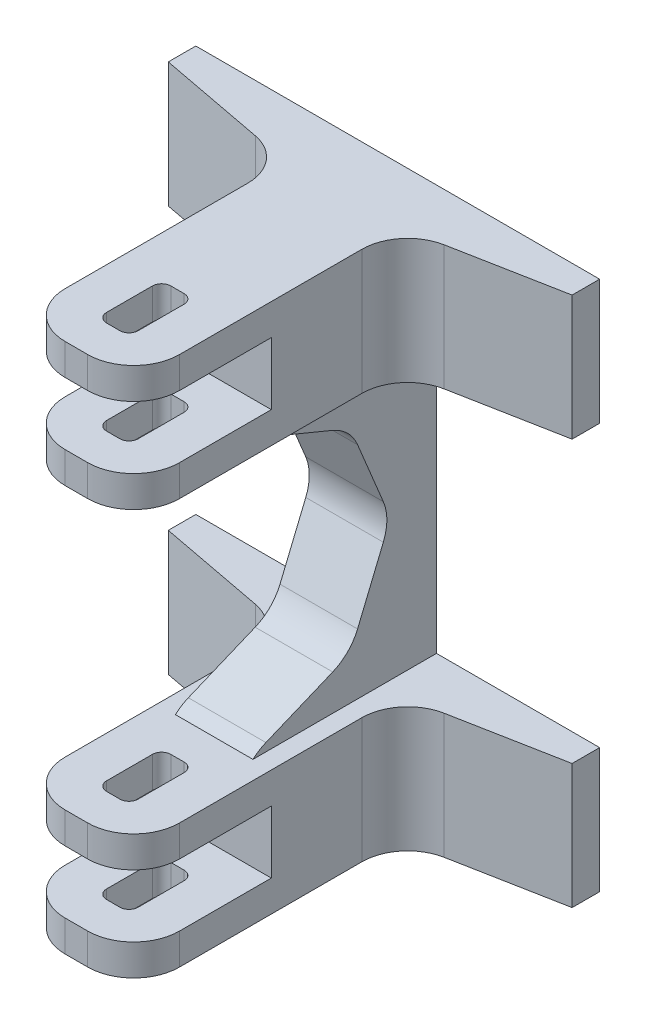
ISO-10303-21;
HEADER;
FILE_DESCRIPTION(('STEP AP214'),'2;1');
FILE_NAME('part.step','',(''),(''),'','','');
FILE_SCHEMA(('AUTOMOTIVE_DESIGN { 1 0 10303 214 1 1 1 1 }'));
ENDSEC;
DATA;
#1=APPLICATION_CONTEXT('core data for automotive mechanical design processes');
#2=APPLICATION_PROTOCOL_DEFINITION('international standard','automotive_design',2000,#1);
#3=PRODUCT_CONTEXT('',#1,'mechanical');
#4=PRODUCT('Part','Part','',(#3));
#5=PRODUCT_RELATED_PRODUCT_CATEGORY('part','',(#4));
#6=PRODUCT_DEFINITION_FORMATION('','',#4);
#7=PRODUCT_DEFINITION_CONTEXT('part definition',#1,'design');
#8=PRODUCT_DEFINITION('design','',#6,#7);
#9=PRODUCT_DEFINITION_SHAPE('','',#8);
#10=(LENGTH_UNIT() NAMED_UNIT(*) SI_UNIT(.MILLI.,.METRE.));
#11=(NAMED_UNIT(*) PLANE_ANGLE_UNIT() SI_UNIT($,.RADIAN.));
#12=(NAMED_UNIT(*) SI_UNIT($,.STERADIAN.) SOLID_ANGLE_UNIT());
#13=UNCERTAINTY_MEASURE_WITH_UNIT(LENGTH_MEASURE(1.E-05),#10,'distance_accuracy_value','');
#14=(GEOMETRIC_REPRESENTATION_CONTEXT(3) GLOBAL_UNCERTAINTY_ASSIGNED_CONTEXT((#13)) GLOBAL_UNIT_ASSIGNED_CONTEXT((#10,
#11,#12)) REPRESENTATION_CONTEXT('',''));
#15=CARTESIAN_POINT('',(0.,0.,0.));
#16=DIRECTION('',(0.,0.,1.));
#17=DIRECTION('',(1.,0.,0.));
#18=AXIS2_PLACEMENT_3D('',#15,#16,#17);
#19=CARTESIAN_POINT('',(0.,57.8,0.));
#20=DIRECTION('',(0.,-1.,0.));
#21=DIRECTION('',(0.,0.,-1.));
#22=AXIS2_PLACEMENT_3D('',#19,#20,#21);
#23=PLANE('',#22);
#24=DIRECTION('',(0.,0.,-1.));
#25=VECTOR('',#24,1.);
#26=CARTESIAN_POINT('',(-1.725,57.8,0.));
#27=LINE('',#26,#25);
#28=CARTESIAN_POINT('',(-1.725,57.8,12.5));
#29=VERTEX_POINT('',#28);
#30=CARTESIAN_POINT('',(-1.725,57.8,7.49955715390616));
#31=VERTEX_POINT('',#30);
#32=EDGE_CURVE('E1069',#29,#31,#27,.T.);
#33=ORIENTED_EDGE('',*,*,#32,.T.);
#34=CARTESIAN_POINT('',(-0.725,57.8,7.49955715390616));
#35=DIRECTION('',(0.,1.,0.));
#36=DIRECTION('',(0.,0.,1.));
#37=AXIS2_PLACEMENT_3D('',#34,#35,#36);
#38=CIRCLE('',#37,1.);
#39=CARTESIAN_POINT('',(-0.724999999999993,57.8,6.49955715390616));
#40=VERTEX_POINT('',#39);
#41=EDGE_CURVE('E1047',#31,#40,#38,.F.);
#42=ORIENTED_EDGE('',*,*,#41,.T.);
#43=DIRECTION('',(-1.,0.,0.));
#44=VECTOR('',#43,1.);
#45=CARTESIAN_POINT('',(0.,57.8,6.49955715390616));
#46=LINE('',#45,#44);
#47=CARTESIAN_POINT('',(0.724999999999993,57.8,6.49955715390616));
#48=VERTEX_POINT('',#47);
#49=EDGE_CURVE('E1051',#48,#40,#46,.T.);
#50=ORIENTED_EDGE('',*,*,#49,.F.);
#51=CARTESIAN_POINT('',(0.725,57.8,7.49955715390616));
#52=DIRECTION('',(0.,1.,0.));
#53=DIRECTION('',(0.,0.,1.));
#54=AXIS2_PLACEMENT_3D('',#51,#52,#53);
#55=CIRCLE('',#54,1.);
#56=CARTESIAN_POINT('',(1.725,57.8,7.49955715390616));
#57=VERTEX_POINT('',#56);
#58=EDGE_CURVE('E1054',#57,#48,#55,.T.);
#59=ORIENTED_EDGE('',*,*,#58,.F.);
#60=DIRECTION('',(0.,0.,-1.));
#61=VECTOR('',#60,1.);
#62=CARTESIAN_POINT('',(1.725,57.8,0.));
#63=LINE('',#62,#61);
#64=CARTESIAN_POINT('',(1.725,57.8,12.5));
#65=VERTEX_POINT('',#64);
#66=EDGE_CURVE('E1057',#65,#57,#63,.T.);
#67=ORIENTED_EDGE('',*,*,#66,.F.);
#68=CARTESIAN_POINT('',(0.725,57.8,12.5));
#69=DIRECTION('',(0.,1.,0.));
#70=DIRECTION('',(0.,0.,1.));
#71=AXIS2_PLACEMENT_3D('',#68,#69,#70);
#72=CIRCLE('',#71,1.);
#73=CARTESIAN_POINT('',(0.724999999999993,57.8,13.5));
#74=VERTEX_POINT('',#73);
#75=EDGE_CURVE('E1060',#74,#65,#72,.T.);
#76=ORIENTED_EDGE('',*,*,#75,.F.);
#77=DIRECTION('',(-1.,0.,0.));
#78=VECTOR('',#77,1.);
#79=CARTESIAN_POINT('',(0.,57.8,13.5));
#80=LINE('',#79,#78);
#81=CARTESIAN_POINT('',(-0.724999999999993,57.8,13.5));
#82=VERTEX_POINT('',#81);
#83=EDGE_CURVE('E1063',#74,#82,#80,.T.);
#84=ORIENTED_EDGE('',*,*,#83,.T.);
#85=CARTESIAN_POINT('',(-0.725,57.8,12.5));
#86=DIRECTION('',(0.,1.,0.));
#87=DIRECTION('',(0.,0.,1.));
#88=AXIS2_PLACEMENT_3D('',#85,#86,#87);
#89=CIRCLE('',#88,1.);
#90=EDGE_CURVE('E1066',#29,#82,#89,.T.);
#91=ORIENTED_EDGE('',*,*,#90,.F.);
#92=EDGE_LOOP('',(#33,#42,#50,#59,#67,#76,#84,#91));
#93=FACE_BOUND('',#92,.T.);
#94=DIRECTION('',(0.,0.,-1.));
#95=VECTOR('',#94,1.);
#96=CARTESIAN_POINT('',(-22.,57.8,-11.5));
#97=LINE('',#96,#95);
#98=CARTESIAN_POINT('',(-22.,57.8,-14.5));
#99=VERTEX_POINT('',#98);
#100=CARTESIAN_POINT('',(-22.,57.8,-17.5));
#101=VERTEX_POINT('',#100);
#102=EDGE_CURVE('E552',#99,#101,#97,.T.);
#103=ORIENTED_EDGE('',*,*,#102,.F.);
#104=DIRECTION('',(0.982393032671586,0.,0.186825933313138));
#105=VECTOR('',#104,1.);
#106=CARTESIAN_POINT('',(1.89339273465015,57.8,-9.95609012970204));
#107=LINE('',#106,#105);
#108=CARTESIAN_POINT('',(-10.2908703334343,57.8,-12.2732241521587));
#109=VERTEX_POINT('',#108);
#110=EDGE_CURVE('E535',#99,#109,#107,.T.);
#111=ORIENTED_EDGE('',*,*,#110,.T.);
#112=CARTESIAN_POINT('',(-11.225,57.8,-7.36125898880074));
#113=DIRECTION('',(0.,-1.,0.));
#114=DIRECTION('',(0.,0.,-1.));
#115=AXIS2_PLACEMENT_3D('',#112,#113,#114);
#116=CIRCLE('',#115,5.);
#117=CARTESIAN_POINT('',(-6.225,57.8,-7.36125898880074));
#118=VERTEX_POINT('',#117);
#119=EDGE_CURVE('E748',#109,#118,#116,.T.);
#120=ORIENTED_EDGE('',*,*,#119,.T.);
#121=DIRECTION('',(0.,0.,1.));
#122=VECTOR('',#121,1.);
#123=CARTESIAN_POINT('',(-6.225,57.8,17.5));
#124=LINE('',#123,#122);
#125=CARTESIAN_POINT('',(-6.225,57.8,12.5));
#126=VERTEX_POINT('',#125);
#127=EDGE_CURVE('E686',#118,#126,#124,.T.);
#128=ORIENTED_EDGE('',*,*,#127,.T.);
#129=CARTESIAN_POINT('',(-1.225,57.8,12.5));
#130=DIRECTION('',(0.,1.,0.));
#131=DIRECTION('',(0.,0.,1.));
#132=AXIS2_PLACEMENT_3D('',#129,#130,#131);
#133=CIRCLE('',#132,5.);
#134=CARTESIAN_POINT('',(-1.22499999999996,57.8,17.5));
#135=VERTEX_POINT('',#134);
#136=EDGE_CURVE('E1134',#126,#135,#133,.T.);
#137=ORIENTED_EDGE('',*,*,#136,.T.);
#138=DIRECTION('',(1.,0.,0.));
#139=VECTOR('',#138,1.);
#140=CARTESIAN_POINT('',(-6.225,57.8,17.5));
#141=LINE('',#140,#139);
#142=CARTESIAN_POINT('',(1.22499999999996,57.8,17.5));
#143=VERTEX_POINT('',#142);
#144=EDGE_CURVE('E688',#135,#143,#141,.T.);
#145=ORIENTED_EDGE('',*,*,#144,.T.);
#146=CARTESIAN_POINT('',(1.225,57.8,12.5));
#147=DIRECTION('',(0.,1.,0.));
#148=DIRECTION('',(0.,0.,1.));
#149=AXIS2_PLACEMENT_3D('',#146,#147,#148);
#150=CIRCLE('',#149,5.);
#151=CARTESIAN_POINT('',(6.225,57.8,12.5));
#152=VERTEX_POINT('',#151);
#153=EDGE_CURVE('E1132',#143,#152,#150,.T.);
#154=ORIENTED_EDGE('',*,*,#153,.T.);
#155=DIRECTION('',(0.,0.,-1.));
#156=VECTOR('',#155,1.);
#157=CARTESIAN_POINT('',(6.225,57.8,17.5));
#158=LINE('',#157,#156);
#159=CARTESIAN_POINT('',(6.225,57.8,-7.36125898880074));
#160=VERTEX_POINT('',#159);
#161=EDGE_CURVE('E681',#152,#160,#158,.T.);
#162=ORIENTED_EDGE('',*,*,#161,.T.);
#163=CARTESIAN_POINT('',(11.225,57.8,-7.36125898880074));
#164=DIRECTION('',(0.,-1.,0.));
#165=DIRECTION('',(0.,0.,-1.));
#166=AXIS2_PLACEMENT_3D('',#163,#164,#165);
#167=CIRCLE('',#166,5.);
#168=CARTESIAN_POINT('',(10.2908703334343,57.8,-12.2732241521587));
#169=VERTEX_POINT('',#168);
#170=EDGE_CURVE('E758',#160,#169,#167,.T.);
#171=ORIENTED_EDGE('',*,*,#170,.T.);
#172=DIRECTION('',(-0.982393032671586,0.,0.186825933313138));
#173=VECTOR('',#172,1.);
#174=CARTESIAN_POINT('',(-1.89339273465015,57.8,-9.95609012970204));
#175=LINE('',#174,#173);
#176=CARTESIAN_POINT('',(22.,57.8,-14.5));
#177=VERTEX_POINT('',#176);
#178=EDGE_CURVE('E1172',#177,#169,#175,.T.);
#179=ORIENTED_EDGE('',*,*,#178,.F.);
#180=DIRECTION('',(0.,0.,-1.));
#181=VECTOR('',#180,1.);
#182=CARTESIAN_POINT('',(22.,57.8,-11.5));
#183=LINE('',#182,#181);
#184=CARTESIAN_POINT('',(22.,57.8,-17.5));
#185=VERTEX_POINT('',#184);
#186=EDGE_CURVE('E884',#177,#185,#183,.T.);
#187=ORIENTED_EDGE('',*,*,#186,.T.);
#188=DIRECTION('',(-1.,0.,0.));
#189=VECTOR('',#188,1.);
#190=CARTESIAN_POINT('',(-6.225,57.8,-17.5));
#191=LINE('',#190,#189);
#192=EDGE_CURVE('E558',#185,#101,#191,.T.);
#193=ORIENTED_EDGE('',*,*,#192,.T.);
#194=EDGE_LOOP('',(#103,#111,#120,#128,#137,#145,#154,#162,#171,#179,#187,#193));
#195=FACE_BOUND('',#194,.T.);
#196=ADVANCED_FACE('F36',(#93,#195),#23,.F.);
#197=CARTESIAN_POINT('',(0.,0.,0.));
#198=DIRECTION('',(0.,-1.,0.));
#199=DIRECTION('',(0.,0.,-1.));
#200=AXIS2_PLACEMENT_3D('',#197,#198,#199);
#201=PLANE('',#200);
#202=DIRECTION('',(0.982393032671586,0.,0.186825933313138));
#203=VECTOR('',#202,1.);
#204=CARTESIAN_POINT('',(1.89339273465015,0.,-9.95609012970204));
#205=LINE('',#204,#203);
#206=CARTESIAN_POINT('',(-22.,0.,-14.5));
#207=VERTEX_POINT('',#206);
#208=CARTESIAN_POINT('',(-10.2908703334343,0.,-12.2732241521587));
#209=VERTEX_POINT('',#208);
#210=EDGE_CURVE('E546',#207,#209,#205,.T.);
#211=ORIENTED_EDGE('',*,*,#210,.F.);
#212=DIRECTION('',(0.,0.,-1.));
#213=VECTOR('',#212,1.);
#214=CARTESIAN_POINT('',(-22.,0.,-11.5));
#215=LINE('',#214,#213);
#216=CARTESIAN_POINT('',(-22.,0.,-17.5));
#217=VERTEX_POINT('',#216);
#218=EDGE_CURVE('E898',#207,#217,#215,.T.);
#219=ORIENTED_EDGE('',*,*,#218,.T.);
#220=DIRECTION('',(-1.,0.,0.));
#221=VECTOR('',#220,1.);
#222=CARTESIAN_POINT('',(-6.225,0.,-17.5));
#223=LINE('',#222,#221);
#224=CARTESIAN_POINT('',(22.,0.,-17.5));
#225=VERTEX_POINT('',#224);
#226=EDGE_CURVE('E694',#225,#217,#223,.T.);
#227=ORIENTED_EDGE('',*,*,#226,.F.);
#228=DIRECTION('',(0.,0.,-1.));
#229=VECTOR('',#228,1.);
#230=CARTESIAN_POINT('',(22.,0.,-11.5));
#231=LINE('',#230,#229);
#232=CARTESIAN_POINT('',(22.,0.,-14.5));
#233=VERTEX_POINT('',#232);
#234=EDGE_CURVE('E890',#233,#225,#231,.T.);
#235=ORIENTED_EDGE('',*,*,#234,.F.);
#236=DIRECTION('',(-0.982393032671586,0.,0.186825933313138));
#237=VECTOR('',#236,1.);
#238=CARTESIAN_POINT('',(-1.89339273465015,0.,-9.95609012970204));
#239=LINE('',#238,#237);
#240=CARTESIAN_POINT('',(10.2908703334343,0.,-12.2732241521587));
#241=VERTEX_POINT('',#240);
#242=EDGE_CURVE('E1169',#233,#241,#239,.T.);
#243=ORIENTED_EDGE('',*,*,#242,.T.);
#244=CARTESIAN_POINT('',(11.225,0.,-7.36125898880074));
#245=DIRECTION('',(0.,-1.,0.));
#246=DIRECTION('',(0.,0.,-1.));
#247=AXIS2_PLACEMENT_3D('',#244,#245,#246);
#248=CIRCLE('',#247,5.);
#249=CARTESIAN_POINT('',(6.225,0.,-7.36125898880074));
#250=VERTEX_POINT('',#249);
#251=EDGE_CURVE('E760',#241,#250,#248,.F.);
#252=ORIENTED_EDGE('',*,*,#251,.T.);
#253=DIRECTION('',(0.,0.,-1.));
#254=VECTOR('',#253,1.);
#255=CARTESIAN_POINT('',(6.225,0.,17.5));
#256=LINE('',#255,#254);
#257=CARTESIAN_POINT('',(6.225,0.,12.5));
#258=VERTEX_POINT('',#257);
#259=EDGE_CURVE('E624',#258,#250,#256,.T.);
#260=ORIENTED_EDGE('',*,*,#259,.F.);
#261=CARTESIAN_POINT('',(1.225,0.,12.5));
#262=DIRECTION('',(0.,1.,0.));
#263=DIRECTION('',(0.,0.,1.));
#264=AXIS2_PLACEMENT_3D('',#261,#262,#263);
#265=CIRCLE('',#264,5.);
#266=CARTESIAN_POINT('',(1.22499999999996,0.,17.5));
#267=VERTEX_POINT('',#266);
#268=EDGE_CURVE('E1150',#267,#258,#265,.T.);
#269=ORIENTED_EDGE('',*,*,#268,.F.);
#270=DIRECTION('',(1.,0.,0.));
#271=VECTOR('',#270,1.);
#272=CARTESIAN_POINT('',(-6.225,0.,17.5));
#273=LINE('',#272,#271);
#274=CARTESIAN_POINT('',(-1.22499999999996,0.,17.5));
#275=VERTEX_POINT('',#274);
#276=EDGE_CURVE('E684',#275,#267,#273,.T.);
#277=ORIENTED_EDGE('',*,*,#276,.F.);
#278=CARTESIAN_POINT('',(-1.225,0.,12.5));
#279=DIRECTION('',(0.,1.,0.));
#280=DIRECTION('',(0.,0.,1.));
#281=AXIS2_PLACEMENT_3D('',#278,#279,#280);
#282=CIRCLE('',#281,5.);
#283=CARTESIAN_POINT('',(-6.225,0.,12.5));
#284=VERTEX_POINT('',#283);
#285=EDGE_CURVE('E1137',#284,#275,#282,.T.);
#286=ORIENTED_EDGE('',*,*,#285,.F.);
#287=DIRECTION('',(0.,0.,1.));
#288=VECTOR('',#287,1.);
#289=CARTESIAN_POINT('',(-6.225,0.,17.5));
#290=LINE('',#289,#288);
#291=CARTESIAN_POINT('',(-6.225,0.,-7.36125898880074));
#292=VERTEX_POINT('',#291);
#293=EDGE_CURVE('E697',#292,#284,#290,.T.);
#294=ORIENTED_EDGE('',*,*,#293,.F.);
#295=CARTESIAN_POINT('',(-11.225,0.,-7.36125898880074));
#296=DIRECTION('',(0.,-1.,0.));
#297=DIRECTION('',(0.,0.,-1.));
#298=AXIS2_PLACEMENT_3D('',#295,#296,#297);
#299=CIRCLE('',#298,5.);
#300=EDGE_CURVE('E754',#292,#209,#299,.F.);
#301=ORIENTED_EDGE('',*,*,#300,.T.);
#302=EDGE_LOOP('',(#211,#219,#227,#235,#243,#252,#260,#269,#277,#286,#294,#301));
#303=FACE_BOUND('',#302,.T.);
#304=CARTESIAN_POINT('',(-0.725,0.,7.49955715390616));
#305=DIRECTION('',(0.,1.,0.));
#306=DIRECTION('',(0.,0.,1.));
#307=AXIS2_PLACEMENT_3D('',#304,#305,#306);
#308=CIRCLE('',#307,1.);
#309=CARTESIAN_POINT('',(-1.725,0.,7.49955715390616));
#310=VERTEX_POINT('',#309);
#311=CARTESIAN_POINT('',(-0.724999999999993,0.,6.49955715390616));
#312=VERTEX_POINT('',#311);
#313=EDGE_CURVE('E1073',#310,#312,#308,.F.);
#314=ORIENTED_EDGE('',*,*,#313,.F.);
#315=DIRECTION('',(0.,0.,-1.));
#316=VECTOR('',#315,1.);
#317=CARTESIAN_POINT('',(-1.725,0.,0.));
#318=LINE('',#317,#316);
#319=CARTESIAN_POINT('',(-1.725,0.,12.5));
#320=VERTEX_POINT('',#319);
#321=EDGE_CURVE('E1050',#320,#310,#318,.T.);
#322=ORIENTED_EDGE('',*,*,#321,.F.);
#323=CARTESIAN_POINT('',(-0.725,0.,12.5));
#324=DIRECTION('',(0.,1.,0.));
#325=DIRECTION('',(0.,0.,1.));
#326=AXIS2_PLACEMENT_3D('',#323,#324,#325);
#327=CIRCLE('',#326,1.);
#328=CARTESIAN_POINT('',(-0.724999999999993,0.,13.5));
#329=VERTEX_POINT('',#328);
#330=EDGE_CURVE('E1090',#320,#329,#327,.T.);
#331=ORIENTED_EDGE('',*,*,#330,.T.);
#332=DIRECTION('',(-1.,0.,0.));
#333=VECTOR('',#332,1.);
#334=CARTESIAN_POINT('',(0.,0.,13.5));
#335=LINE('',#334,#333);
#336=CARTESIAN_POINT('',(0.724999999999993,0.,13.5));
#337=VERTEX_POINT('',#336);
#338=EDGE_CURVE('E1087',#337,#329,#335,.T.);
#339=ORIENTED_EDGE('',*,*,#338,.F.);
#340=CARTESIAN_POINT('',(0.725,0.,12.5));
#341=DIRECTION('',(0.,1.,0.));
#342=DIRECTION('',(0.,0.,1.));
#343=AXIS2_PLACEMENT_3D('',#340,#341,#342);
#344=CIRCLE('',#343,1.);
#345=CARTESIAN_POINT('',(1.725,0.,12.5));
#346=VERTEX_POINT('',#345);
#347=EDGE_CURVE('E1084',#337,#346,#344,.T.);
#348=ORIENTED_EDGE('',*,*,#347,.T.);
#349=DIRECTION('',(0.,0.,-1.));
#350=VECTOR('',#349,1.);
#351=CARTESIAN_POINT('',(1.725,0.,0.));
#352=LINE('',#351,#350);
#353=CARTESIAN_POINT('',(1.725,0.,7.49955715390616));
#354=VERTEX_POINT('',#353);
#355=EDGE_CURVE('E1081',#346,#354,#352,.T.);
#356=ORIENTED_EDGE('',*,*,#355,.T.);
#357=CARTESIAN_POINT('',(0.725,0.,7.49955715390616));
#358=DIRECTION('',(0.,1.,0.));
#359=DIRECTION('',(0.,0.,1.));
#360=AXIS2_PLACEMENT_3D('',#357,#358,#359);
#361=CIRCLE('',#360,1.);
#362=CARTESIAN_POINT('',(0.724999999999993,0.,6.49955715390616));
#363=VERTEX_POINT('',#362);
#364=EDGE_CURVE('E1078',#354,#363,#361,.T.);
#365=ORIENTED_EDGE('',*,*,#364,.T.);
#366=DIRECTION('',(-1.,0.,0.));
#367=VECTOR('',#366,1.);
#368=CARTESIAN_POINT('',(0.,0.,6.49955715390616));
#369=LINE('',#368,#367);
#370=EDGE_CURVE('E1075',#363,#312,#369,.T.);
#371=ORIENTED_EDGE('',*,*,#370,.T.);
#372=EDGE_LOOP('',(#314,#322,#331,#339,#348,#356,#365,#371));
#373=FACE_BOUND('',#372,.T.);
#374=ADVANCED_FACE('F1276',(#303,#373),#201,.T.);
#375=CARTESIAN_POINT('',(-6.225,13.6,0.));
#376=DIRECTION('',(0.,-1.,0.));
#377=DIRECTION('',(0.,0.,-1.));
#378=AXIS2_PLACEMENT_3D('',#375,#376,#377);
#379=PLANE('',#378);
#380=DIRECTION('',(0.,0.,1.));
#381=VECTOR('',#380,1.);
#382=CARTESIAN_POINT('',(-1.725,13.6,0.));
#383=LINE('',#382,#381);
#384=CARTESIAN_POINT('',(-1.725,13.6,7.49955715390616));
#385=VERTEX_POINT('',#384);
#386=CARTESIAN_POINT('',(-1.725,13.6,12.5));
#387=VERTEX_POINT('',#386);
#388=EDGE_CURVE('E904',#385,#387,#383,.T.);
#389=ORIENTED_EDGE('',*,*,#388,.F.);
#390=CARTESIAN_POINT('',(-0.725,13.6,7.49955715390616));
#391=DIRECTION('',(0.,-1.,0.));
#392=DIRECTION('',(0.,0.,-1.));
#393=AXIS2_PLACEMENT_3D('',#390,#391,#392);
#394=CIRCLE('',#393,1.);
#395=CARTESIAN_POINT('',(-0.724999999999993,13.6,6.49955715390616));
#396=VERTEX_POINT('',#395);
#397=EDGE_CURVE('E919',#396,#385,#394,.F.);
#398=ORIENTED_EDGE('',*,*,#397,.F.);
#399=DIRECTION('',(1.,0.,0.));
#400=VECTOR('',#399,1.);
#401=CARTESIAN_POINT('',(-6.225,13.6,6.49955715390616));
#402=LINE('',#401,#400);
#403=CARTESIAN_POINT('',(0.724999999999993,13.6,6.49955715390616));
#404=VERTEX_POINT('',#403);
#405=EDGE_CURVE('E931',#396,#404,#402,.T.);
#406=ORIENTED_EDGE('',*,*,#405,.T.);
#407=CARTESIAN_POINT('',(0.725,13.6,7.49955715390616));
#408=DIRECTION('',(0.,-1.,0.));
#409=DIRECTION('',(0.,0.,-1.));
#410=AXIS2_PLACEMENT_3D('',#407,#408,#409);
#411=CIRCLE('',#410,1.);
#412=CARTESIAN_POINT('',(1.725,13.6,7.49955715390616));
#413=VERTEX_POINT('',#412);
#414=EDGE_CURVE('E944',#404,#413,#411,.T.);
#415=ORIENTED_EDGE('',*,*,#414,.T.);
#416=DIRECTION('',(0.,0.,1.));
#417=VECTOR('',#416,1.);
#418=CARTESIAN_POINT('',(1.725,13.6,0.));
#419=LINE('',#418,#417);
#420=CARTESIAN_POINT('',(1.725,13.6,12.5));
#421=VERTEX_POINT('',#420);
#422=EDGE_CURVE('E957',#413,#421,#419,.T.);
#423=ORIENTED_EDGE('',*,*,#422,.T.);
#424=CARTESIAN_POINT('',(0.725,13.6,12.5));
#425=DIRECTION('',(0.,-1.,0.));
#426=DIRECTION('',(0.,0.,-1.));
#427=AXIS2_PLACEMENT_3D('',#424,#425,#426);
#428=CIRCLE('',#427,1.);
#429=CARTESIAN_POINT('',(0.724999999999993,13.6,13.5));
#430=VERTEX_POINT('',#429);
#431=EDGE_CURVE('E970',#421,#430,#428,.T.);
#432=ORIENTED_EDGE('',*,*,#431,.T.);
#433=DIRECTION('',(1.,0.,0.));
#434=VECTOR('',#433,1.);
#435=CARTESIAN_POINT('',(-6.225,13.6,13.5));
#436=LINE('',#435,#434);
#437=CARTESIAN_POINT('',(-0.724999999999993,13.6,13.5));
#438=VERTEX_POINT('',#437);
#439=EDGE_CURVE('E983',#438,#430,#436,.T.);
#440=ORIENTED_EDGE('',*,*,#439,.F.);
#441=CARTESIAN_POINT('',(-0.725,13.6,12.5));
#442=DIRECTION('',(0.,-1.,0.));
#443=DIRECTION('',(0.,0.,-1.));
#444=AXIS2_PLACEMENT_3D('',#441,#442,#443);
#445=CIRCLE('',#444,1.);
#446=EDGE_CURVE('E995',#438,#387,#445,.T.);
#447=ORIENTED_EDGE('',*,*,#446,.T.);
#448=EDGE_LOOP('',(#389,#398,#406,#415,#423,#432,#440,#447));
#449=FACE_BOUND('',#448,.T.);
#450=DIRECTION('',(0.,0.,-1.));
#451=VECTOR('',#450,1.);
#452=CARTESIAN_POINT('',(-22.,13.6,-11.5));
#453=LINE('',#452,#451);
#454=CARTESIAN_POINT('',(-22.,13.6,-14.5));
#455=VERTEX_POINT('',#454);
#456=CARTESIAN_POINT('',(-22.,13.6,-17.5));
#457=VERTEX_POINT('',#456);
#458=EDGE_CURVE('E897',#455,#457,#453,.T.);
#459=ORIENTED_EDGE('',*,*,#458,.F.);
#460=DIRECTION('',(0.982393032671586,0.,0.186825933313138));
#461=VECTOR('',#460,1.);
#462=CARTESIAN_POINT('',(-4.11433030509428,13.6,-11.0986048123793));
#463=LINE('',#462,#461);
#464=CARTESIAN_POINT('',(-10.2908703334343,13.6,-12.2732241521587));
#465=VERTEX_POINT('',#464);
#466=EDGE_CURVE('E1162',#455,#465,#463,.T.);
#467=ORIENTED_EDGE('',*,*,#466,.T.);
#468=CARTESIAN_POINT('',(-11.225,13.6,-7.36125898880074));
#469=DIRECTION('',(0.,-1.,0.));
#470=DIRECTION('',(0.,0.,-1.));
#471=AXIS2_PLACEMENT_3D('',#468,#469,#470);
#472=CIRCLE('',#471,5.);
#473=CARTESIAN_POINT('',(-6.225,13.6,-7.36125898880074));
#474=VERTEX_POINT('',#473);
#475=EDGE_CURVE('E752',#465,#474,#472,.T.);
#476=ORIENTED_EDGE('',*,*,#475,.T.);
#477=DIRECTION('',(0.,0.,-1.));
#478=VECTOR('',#477,1.);
#479=CARTESIAN_POINT('',(-6.225,13.6,0.));
#480=LINE('',#479,#478);
#481=CARTESIAN_POINT('',(-6.225,13.6,12.5));
#482=VERTEX_POINT('',#481);
#483=EDGE_CURVE('E659',#482,#474,#480,.T.);
#484=ORIENTED_EDGE('',*,*,#483,.F.);
#485=CARTESIAN_POINT('',(-1.225,13.6,12.5));
#486=DIRECTION('',(0.,-1.,0.));
#487=DIRECTION('',(0.,0.,-1.));
#488=AXIS2_PLACEMENT_3D('',#485,#486,#487);
#489=CIRCLE('',#488,5.);
#490=CARTESIAN_POINT('',(-1.22499999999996,13.6,17.5));
#491=VERTEX_POINT('',#490);
#492=EDGE_CURVE('E1108',#491,#482,#489,.T.);
#493=ORIENTED_EDGE('',*,*,#492,.F.);
#494=DIRECTION('',(1.,0.,0.));
#495=VECTOR('',#494,1.);
#496=CARTESIAN_POINT('',(-6.225,13.6,17.5));
#497=LINE('',#496,#495);
#498=CARTESIAN_POINT('',(1.225,13.6,17.5));
#499=VERTEX_POINT('',#498);
#500=EDGE_CURVE('E646',#491,#499,#497,.T.);
#501=ORIENTED_EDGE('',*,*,#500,.T.);
#502=CARTESIAN_POINT('',(1.225,13.6,12.5));
#503=DIRECTION('',(0.,-1.,0.));
#504=DIRECTION('',(0.,0.,-1.));
#505=AXIS2_PLACEMENT_3D('',#502,#503,#504);
#506=CIRCLE('',#505,5.);
#507=CARTESIAN_POINT('',(6.225,13.6,12.5));
#508=VERTEX_POINT('',#507);
#509=EDGE_CURVE('E1072',#508,#499,#506,.T.);
#510=ORIENTED_EDGE('',*,*,#509,.F.);
#511=DIRECTION('',(0.,0.,-1.));
#512=VECTOR('',#511,1.);
#513=CARTESIAN_POINT('',(6.225,13.6,0.));
#514=LINE('',#513,#512);
#515=CARTESIAN_POINT('',(6.225,13.6,-7.36125898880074));
#516=VERTEX_POINT('',#515);
#517=EDGE_CURVE('E602',#508,#516,#514,.T.);
#518=ORIENTED_EDGE('',*,*,#517,.T.);
#519=CARTESIAN_POINT('',(11.225,13.6,-7.36125898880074));
#520=DIRECTION('',(0.,-1.,0.));
#521=DIRECTION('',(0.,0.,-1.));
#522=AXIS2_PLACEMENT_3D('',#519,#520,#521);
#523=CIRCLE('',#522,5.);
#524=CARTESIAN_POINT('',(10.2908703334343,13.6,-12.2732241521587));
#525=VERTEX_POINT('',#524);
#526=EDGE_CURVE('E762',#516,#525,#523,.T.);
#527=ORIENTED_EDGE('',*,*,#526,.T.);
#528=DIRECTION('',(-0.982393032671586,0.,0.186825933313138));
#529=VECTOR('',#528,1.);
#530=CARTESIAN_POINT('',(-7.90111577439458,13.6,-8.8135754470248));
#531=LINE('',#530,#529);
#532=CARTESIAN_POINT('',(22.,13.6,-14.5));
#533=VERTEX_POINT('',#532);
#534=EDGE_CURVE('E1157',#533,#525,#531,.T.);
#535=ORIENTED_EDGE('',*,*,#534,.F.);
#536=DIRECTION('',(0.,0.,-1.));
#537=VECTOR('',#536,1.);
#538=CARTESIAN_POINT('',(22.,13.6,-11.5));
#539=LINE('',#538,#537);
#540=CARTESIAN_POINT('',(22.,13.6,-17.5));
#541=VERTEX_POINT('',#540);
#542=EDGE_CURVE('E891',#533,#541,#539,.T.);
#543=ORIENTED_EDGE('',*,*,#542,.T.);
#544=DIRECTION('',(1.,0.,0.));
#545=VECTOR('',#544,1.);
#546=CARTESIAN_POINT('',(4.225,13.6,-17.5));
#547=LINE('',#546,#545);
#548=CARTESIAN_POINT('',(4.225,13.6,-17.5));
#549=VERTEX_POINT('',#548);
#550=EDGE_CURVE('E585',#549,#541,#547,.T.);
#551=ORIENTED_EDGE('',*,*,#550,.F.);
#552=DIRECTION('',(0.,0.,-1.));
#553=VECTOR('',#552,1.);
#554=CARTESIAN_POINT('',(4.225,13.6,0.));
#555=LINE('',#554,#553);
#556=CARTESIAN_POINT('',(4.225,13.6,2.5));
#557=VERTEX_POINT('',#556);
#558=EDGE_CURVE('E572',#557,#549,#555,.T.);
#559=ORIENTED_EDGE('',*,*,#558,.F.);
#560=DIRECTION('',(1.,0.,0.));
#561=VECTOR('',#560,1.);
#562=CARTESIAN_POINT('',(-6.225,13.6,2.5));
#563=LINE('',#562,#561);
#564=CARTESIAN_POINT('',(-4.225,13.6,2.5));
#565=VERTEX_POINT('',#564);
#566=EDGE_CURVE('E666',#565,#557,#563,.T.);
#567=ORIENTED_EDGE('',*,*,#566,.F.);
#568=DIRECTION('',(0.,0.,1.));
#569=VECTOR('',#568,1.);
#570=CARTESIAN_POINT('',(-4.225,13.6,2.5));
#571=LINE('',#570,#569);
#572=CARTESIAN_POINT('',(-4.225,13.6,-17.5));
#573=VERTEX_POINT('',#572);
#574=EDGE_CURVE('E596',#573,#565,#571,.T.);
#575=ORIENTED_EDGE('',*,*,#574,.F.);
#576=DIRECTION('',(-1.,0.,0.));
#577=VECTOR('',#576,1.);
#578=CARTESIAN_POINT('',(-4.225,13.6,-17.5));
#579=LINE('',#578,#577);
#580=EDGE_CURVE('E599',#573,#457,#579,.T.);
#581=ORIENTED_EDGE('',*,*,#580,.T.);
#582=EDGE_LOOP('',(#459,#467,#476,#484,#493,#501,#510,#518,#527,#535,#543,#551,#559,#567,#575,#581));
#583=FACE_BOUND('',#582,.T.);
#584=ADVANCED_FACE('F848',(#449,#583),#379,.F.);
#585=CARTESIAN_POINT('',(-6.225,44.2,0.));
#586=DIRECTION('',(0.,-1.,0.));
#587=DIRECTION('',(0.,0.,-1.));
#588=AXIS2_PLACEMENT_3D('',#585,#586,#587);
#589=PLANE('',#588);
#590=DIRECTION('',(0.982393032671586,0.,0.186825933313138));
#591=VECTOR('',#590,1.);
#592=CARTESIAN_POINT('',(-4.11433030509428,44.2,-11.0986048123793));
#593=LINE('',#592,#591);
#594=CARTESIAN_POINT('',(-22.,44.2,-14.5));
#595=VERTEX_POINT('',#594);
#596=CARTESIAN_POINT('',(-10.2908703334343,44.2,-12.2732241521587));
#597=VERTEX_POINT('',#596);
#598=EDGE_CURVE('E555',#595,#597,#593,.T.);
#599=ORIENTED_EDGE('',*,*,#598,.F.);
#600=DIRECTION('',(0.,0.,-1.));
#601=VECTOR('',#600,1.);
#602=CARTESIAN_POINT('',(-22.,44.2,-11.5));
#603=LINE('',#602,#601);
#604=CARTESIAN_POINT('',(-22.,44.2,-17.5));
#605=VERTEX_POINT('',#604);
#606=EDGE_CURVE('E554',#595,#605,#603,.T.);
#607=ORIENTED_EDGE('',*,*,#606,.T.);
#608=DIRECTION('',(-1.,0.,0.));
#609=VECTOR('',#608,1.);
#610=CARTESIAN_POINT('',(-4.225,44.2,-17.5));
#611=LINE('',#610,#609);
#612=CARTESIAN_POINT('',(-4.225,44.2,-17.5));
#613=VERTEX_POINT('',#612);
#614=EDGE_CURVE('E598',#613,#605,#611,.T.);
#615=ORIENTED_EDGE('',*,*,#614,.F.);
#616=DIRECTION('',(0.,0.,-1.));
#617=VECTOR('',#616,1.);
#618=CARTESIAN_POINT('',(-4.225,44.2,2.5));
#619=LINE('',#618,#617);
#620=CARTESIAN_POINT('',(-4.225,44.2,2.5));
#621=VERTEX_POINT('',#620);
#622=EDGE_CURVE('E589',#621,#613,#619,.T.);
#623=ORIENTED_EDGE('',*,*,#622,.F.);
#624=DIRECTION('',(1.,0.,0.));
#625=VECTOR('',#624,1.);
#626=CARTESIAN_POINT('',(-6.225,44.2,2.5));
#627=LINE('',#626,#625);
#628=CARTESIAN_POINT('',(4.225,44.2,2.5));
#629=VERTEX_POINT('',#628);
#630=EDGE_CURVE('E676',#621,#629,#627,.T.);
#631=ORIENTED_EDGE('',*,*,#630,.T.);
#632=DIRECTION('',(0.,0.,-1.));
#633=VECTOR('',#632,1.);
#634=CARTESIAN_POINT('',(4.225,44.2,0.));
#635=LINE('',#634,#633);
#636=CARTESIAN_POINT('',(4.225,44.2,-17.5));
#637=VERTEX_POINT('',#636);
#638=EDGE_CURVE('E578',#629,#637,#635,.T.);
#639=ORIENTED_EDGE('',*,*,#638,.T.);
#640=DIRECTION('',(1.,0.,0.));
#641=VECTOR('',#640,1.);
#642=CARTESIAN_POINT('',(4.225,44.2,-17.5));
#643=LINE('',#642,#641);
#644=CARTESIAN_POINT('',(22.,44.2,-17.5));
#645=VERTEX_POINT('',#644);
#646=EDGE_CURVE('E586',#637,#645,#643,.T.);
#647=ORIENTED_EDGE('',*,*,#646,.T.);
#648=DIRECTION('',(0.,0.,-1.));
#649=VECTOR('',#648,1.);
#650=CARTESIAN_POINT('',(22.,44.2,-11.5));
#651=LINE('',#650,#649);
#652=CARTESIAN_POINT('',(22.,44.2,-14.5));
#653=VERTEX_POINT('',#652);
#654=EDGE_CURVE('E837',#653,#645,#651,.T.);
#655=ORIENTED_EDGE('',*,*,#654,.F.);
#656=DIRECTION('',(-0.982393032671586,0.,0.186825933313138));
#657=VECTOR('',#656,1.);
#658=CARTESIAN_POINT('',(-7.90111577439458,44.2,-8.8135754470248));
#659=LINE('',#658,#657);
#660=CARTESIAN_POINT('',(10.2908703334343,44.2,-12.2732241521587));
#661=VERTEX_POINT('',#660);
#662=EDGE_CURVE('E1160',#653,#661,#659,.T.);
#663=ORIENTED_EDGE('',*,*,#662,.T.);
#664=CARTESIAN_POINT('',(11.225,44.2,-7.36125898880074));
#665=DIRECTION('',(0.,-1.,0.));
#666=DIRECTION('',(0.,0.,-1.));
#667=AXIS2_PLACEMENT_3D('',#664,#665,#666);
#668=CIRCLE('',#667,5.);
#669=CARTESIAN_POINT('',(6.225,44.2,-7.36125898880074));
#670=VERTEX_POINT('',#669);
#671=EDGE_CURVE('E756',#661,#670,#668,.F.);
#672=ORIENTED_EDGE('',*,*,#671,.T.);
#673=DIRECTION('',(0.,0.,-1.));
#674=VECTOR('',#673,1.);
#675=CARTESIAN_POINT('',(6.225,44.2,0.));
#676=LINE('',#675,#674);
#677=CARTESIAN_POINT('',(6.225,44.2,12.5));
#678=VERTEX_POINT('',#677);
#679=EDGE_CURVE('E663',#678,#670,#676,.T.);
#680=ORIENTED_EDGE('',*,*,#679,.F.);
#681=CARTESIAN_POINT('',(1.225,44.2,12.5));
#682=DIRECTION('',(0.,-1.,0.));
#683=DIRECTION('',(0.,0.,-1.));
#684=AXIS2_PLACEMENT_3D('',#681,#682,#683);
#685=CIRCLE('',#684,5.);
#686=CARTESIAN_POINT('',(1.22499999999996,44.2,17.5));
#687=VERTEX_POINT('',#686);
#688=EDGE_CURVE('E1095',#678,#687,#685,.T.);
#689=ORIENTED_EDGE('',*,*,#688,.T.);
#690=DIRECTION('',(1.,0.,0.));
#691=VECTOR('',#690,1.);
#692=CARTESIAN_POINT('',(-6.225,44.2,17.5));
#693=LINE('',#692,#691);
#694=CARTESIAN_POINT('',(-1.225,44.2,17.5));
#695=VERTEX_POINT('',#694);
#696=EDGE_CURVE('E673',#695,#687,#693,.T.);
#697=ORIENTED_EDGE('',*,*,#696,.F.);
#698=CARTESIAN_POINT('',(-1.225,44.2,12.5));
#699=DIRECTION('',(0.,-1.,0.));
#700=DIRECTION('',(0.,0.,-1.));
#701=AXIS2_PLACEMENT_3D('',#698,#699,#700);
#702=CIRCLE('',#701,5.);
#703=CARTESIAN_POINT('',(-6.225,44.2,12.5));
#704=VERTEX_POINT('',#703);
#705=EDGE_CURVE('E1110',#695,#704,#702,.T.);
#706=ORIENTED_EDGE('',*,*,#705,.T.);
#707=DIRECTION('',(0.,0.,-1.));
#708=VECTOR('',#707,1.);
#709=CARTESIAN_POINT('',(-6.225,44.2,0.));
#710=LINE('',#709,#708);
#711=CARTESIAN_POINT('',(-6.225,44.2,-7.36125898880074));
#712=VERTEX_POINT('',#711);
#713=EDGE_CURVE('E662',#704,#712,#710,.T.);
#714=ORIENTED_EDGE('',*,*,#713,.T.);
#715=CARTESIAN_POINT('',(-11.225,44.2,-7.36125898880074));
#716=DIRECTION('',(0.,-1.,0.));
#717=DIRECTION('',(0.,0.,-1.));
#718=AXIS2_PLACEMENT_3D('',#715,#716,#717);
#719=CIRCLE('',#718,5.);
#720=EDGE_CURVE('E750',#712,#597,#719,.F.);
#721=ORIENTED_EDGE('',*,*,#720,.T.);
#722=EDGE_LOOP('',(#599,#607,#615,#623,#631,#639,#647,#655,#663,#672,#680,#689,#697,#706,#714,#721));
#723=FACE_BOUND('',#722,.T.);
#724=CARTESIAN_POINT('',(-0.725,44.2,7.49955715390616));
#725=DIRECTION('',(0.,-1.,0.));
#726=DIRECTION('',(0.,0.,-1.));
#727=AXIS2_PLACEMENT_3D('',#724,#725,#726);
#728=CIRCLE('',#727,1.);
#729=CARTESIAN_POINT('',(-0.724999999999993,44.2,6.49955715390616));
#730=VERTEX_POINT('',#729);
#731=CARTESIAN_POINT('',(-1.725,44.2,7.49955715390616));
#732=VERTEX_POINT('',#731);
#733=EDGE_CURVE('E921',#730,#732,#728,.F.);
#734=ORIENTED_EDGE('',*,*,#733,.T.);
#735=DIRECTION('',(0.,0.,1.));
#736=VECTOR('',#735,1.);
#737=CARTESIAN_POINT('',(-1.725,44.2,0.));
#738=LINE('',#737,#736);
#739=CARTESIAN_POINT('',(-1.725,44.2,12.5));
#740=VERTEX_POINT('',#739);
#741=EDGE_CURVE('E907',#732,#740,#738,.T.);
#742=ORIENTED_EDGE('',*,*,#741,.T.);
#743=CARTESIAN_POINT('',(-0.725,44.2,12.5));
#744=DIRECTION('',(0.,-1.,0.));
#745=DIRECTION('',(0.,0.,-1.));
#746=AXIS2_PLACEMENT_3D('',#743,#744,#745);
#747=CIRCLE('',#746,1.);
#748=CARTESIAN_POINT('',(-0.724999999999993,44.2,13.5));
#749=VERTEX_POINT('',#748);
#750=EDGE_CURVE('E998',#749,#740,#747,.T.);
#751=ORIENTED_EDGE('',*,*,#750,.F.);
#752=DIRECTION('',(1.,0.,0.));
#753=VECTOR('',#752,1.);
#754=CARTESIAN_POINT('',(-6.225,44.2,13.5));
#755=LINE('',#754,#753);
#756=CARTESIAN_POINT('',(0.724999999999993,44.2,13.5));
#757=VERTEX_POINT('',#756);
#758=EDGE_CURVE('E985',#749,#757,#755,.T.);
#759=ORIENTED_EDGE('',*,*,#758,.T.);
#760=CARTESIAN_POINT('',(0.725,44.2,12.5));
#761=DIRECTION('',(0.,-1.,0.));
#762=DIRECTION('',(0.,0.,-1.));
#763=AXIS2_PLACEMENT_3D('',#760,#761,#762);
#764=CIRCLE('',#763,1.);
#765=CARTESIAN_POINT('',(1.725,44.2,12.5));
#766=VERTEX_POINT('',#765);
#767=EDGE_CURVE('E973',#766,#757,#764,.T.);
#768=ORIENTED_EDGE('',*,*,#767,.F.);
#769=DIRECTION('',(0.,0.,1.));
#770=VECTOR('',#769,1.);
#771=CARTESIAN_POINT('',(1.725,44.2,0.));
#772=LINE('',#771,#770);
#773=CARTESIAN_POINT('',(1.725,44.2,7.49955715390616));
#774=VERTEX_POINT('',#773);
#775=EDGE_CURVE('E960',#774,#766,#772,.T.);
#776=ORIENTED_EDGE('',*,*,#775,.F.);
#777=CARTESIAN_POINT('',(0.725,44.2,7.49955715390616));
#778=DIRECTION('',(0.,-1.,0.));
#779=DIRECTION('',(0.,0.,-1.));
#780=AXIS2_PLACEMENT_3D('',#777,#778,#779);
#781=CIRCLE('',#780,1.);
#782=CARTESIAN_POINT('',(0.724999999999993,44.2,6.49955715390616));
#783=VERTEX_POINT('',#782);
#784=EDGE_CURVE('E947',#783,#774,#781,.T.);
#785=ORIENTED_EDGE('',*,*,#784,.F.);
#786=DIRECTION('',(1.,0.,0.));
#787=VECTOR('',#786,1.);
#788=CARTESIAN_POINT('',(-6.225,44.2,6.49955715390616));
#789=LINE('',#788,#787);
#790=EDGE_CURVE('E934',#730,#783,#789,.T.);
#791=ORIENTED_EDGE('',*,*,#790,.F.);
#792=EDGE_LOOP('',(#734,#742,#751,#759,#768,#776,#785,#791));
#793=FACE_BOUND('',#792,.T.);
#794=ADVANCED_FACE('F834',(#723,#793),#589,.T.);
#795=CARTESIAN_POINT('',(22.,0.,-11.5));
#796=DIRECTION('',(-1.,0.,0.));
#797=DIRECTION('',(0.,0.,1.));
#798=AXIS2_PLACEMENT_3D('',#795,#796,#797);
#799=PLANE('',#798);
#800=DIRECTION('',(0.,-1.,0.));
#801=VECTOR('',#800,1.);
#802=CARTESIAN_POINT('',(22.,57.8,-14.5));
#803=LINE('',#802,#801);
#804=EDGE_CURVE('E1166',#177,#653,#803,.T.);
#805=ORIENTED_EDGE('',*,*,#804,.T.);
#806=ORIENTED_EDGE('',*,*,#654,.T.);
#807=DIRECTION('',(0.,1.,0.));
#808=VECTOR('',#807,1.);
#809=CARTESIAN_POINT('',(22.,0.,-17.5));
#810=LINE('',#809,#808);
#811=EDGE_CURVE('E831',#645,#185,#810,.T.);
#812=ORIENTED_EDGE('',*,*,#811,.T.);
#813=ORIENTED_EDGE('',*,*,#186,.F.);
#814=EDGE_LOOP('',(#805,#806,#812,#813));
#815=FACE_BOUND('',#814,.T.);
#816=ADVANCED_FACE('F1263',(#815),#799,.F.);
#817=CARTESIAN_POINT('',(22.,0.,-11.5));
#818=DIRECTION('',(-1.,0.,0.));
#819=DIRECTION('',(0.,0.,1.));
#820=AXIS2_PLACEMENT_3D('',#817,#818,#819);
#821=PLANE('',#820);
#822=EDGE_CURVE('E1168',#533,#233,#803,.T.);
#823=ORIENTED_EDGE('',*,*,#822,.T.);
#824=ORIENTED_EDGE('',*,*,#234,.T.);
#825=DIRECTION('',(0.,1.,0.));
#826=VECTOR('',#825,1.);
#827=CARTESIAN_POINT('',(22.,0.,-17.5));
#828=LINE('',#827,#826);
#829=EDGE_CURVE('E893',#225,#541,#828,.T.);
#830=ORIENTED_EDGE('',*,*,#829,.T.);
#831=ORIENTED_EDGE('',*,*,#542,.F.);
#832=EDGE_LOOP('',(#823,#824,#830,#831));
#833=FACE_BOUND('',#832,.T.);
#834=ADVANCED_FACE('F1265',(#833),#821,.F.);
#835=CARTESIAN_POINT('',(-6.225,47.6,0.));
#836=DIRECTION('',(0.,-1.,0.));
#837=DIRECTION('',(0.,0.,-1.));
#838=AXIS2_PLACEMENT_3D('',#835,#836,#837);
#839=PLANE('',#838);
#840=DIRECTION('',(0.,0.,1.));
#841=VECTOR('',#840,1.);
#842=CARTESIAN_POINT('',(-1.725,47.6,0.));
#843=LINE('',#842,#841);
#844=CARTESIAN_POINT('',(-1.725,47.6,7.49955715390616));
#845=VERTEX_POINT('',#844);
#846=CARTESIAN_POINT('',(-1.725,47.6,12.5));
#847=VERTEX_POINT('',#846);
#848=EDGE_CURVE('E910',#845,#847,#843,.T.);
#849=ORIENTED_EDGE('',*,*,#848,.F.);
#850=CARTESIAN_POINT('',(-0.725,47.6,7.49955715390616));
#851=DIRECTION('',(0.,-1.,0.));
#852=DIRECTION('',(0.,0.,-1.));
#853=AXIS2_PLACEMENT_3D('',#850,#851,#852);
#854=CIRCLE('',#853,1.);
#855=CARTESIAN_POINT('',(-0.724999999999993,47.6,6.49955715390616));
#856=VERTEX_POINT('',#855);
#857=EDGE_CURVE('E924',#856,#845,#854,.F.);
#858=ORIENTED_EDGE('',*,*,#857,.F.);
#859=DIRECTION('',(1.,0.,0.));
#860=VECTOR('',#859,1.);
#861=CARTESIAN_POINT('',(-6.225,47.6,6.49955715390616));
#862=LINE('',#861,#860);
#863=CARTESIAN_POINT('',(0.724999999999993,47.6,6.49955715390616));
#864=VERTEX_POINT('',#863);
#865=EDGE_CURVE('E936',#856,#864,#862,.T.);
#866=ORIENTED_EDGE('',*,*,#865,.T.);
#867=CARTESIAN_POINT('',(0.725,47.6,7.49955715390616));
#868=DIRECTION('',(0.,-1.,0.));
#869=DIRECTION('',(0.,0.,-1.));
#870=AXIS2_PLACEMENT_3D('',#867,#868,#869);
#871=CIRCLE('',#870,1.);
#872=CARTESIAN_POINT('',(1.725,47.6,7.49955715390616));
#873=VERTEX_POINT('',#872);
#874=EDGE_CURVE('E949',#864,#873,#871,.T.);
#875=ORIENTED_EDGE('',*,*,#874,.T.);
#876=DIRECTION('',(0.,0.,1.));
#877=VECTOR('',#876,1.);
#878=CARTESIAN_POINT('',(1.725,47.6,0.));
#879=LINE('',#878,#877);
#880=CARTESIAN_POINT('',(1.725,47.6,12.5));
#881=VERTEX_POINT('',#880);
#882=EDGE_CURVE('E962',#873,#881,#879,.T.);
#883=ORIENTED_EDGE('',*,*,#882,.T.);
#884=CARTESIAN_POINT('',(0.725,47.6,12.5));
#885=DIRECTION('',(0.,-1.,0.));
#886=DIRECTION('',(0.,0.,-1.));
#887=AXIS2_PLACEMENT_3D('',#884,#885,#886);
#888=CIRCLE('',#887,1.);
#889=CARTESIAN_POINT('',(0.724999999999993,47.6,13.5));
#890=VERTEX_POINT('',#889);
#891=EDGE_CURVE('E975',#881,#890,#888,.T.);
#892=ORIENTED_EDGE('',*,*,#891,.T.);
#893=DIRECTION('',(1.,0.,0.));
#894=VECTOR('',#893,1.);
#895=CARTESIAN_POINT('',(-6.225,47.6,13.5));
#896=LINE('',#895,#894);
#897=CARTESIAN_POINT('',(-0.724999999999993,47.6,13.5));
#898=VERTEX_POINT('',#897);
#899=EDGE_CURVE('E988',#898,#890,#896,.T.);
#900=ORIENTED_EDGE('',*,*,#899,.F.);
#901=CARTESIAN_POINT('',(-0.725,47.6,12.5));
#902=DIRECTION('',(0.,-1.,0.));
#903=DIRECTION('',(0.,0.,-1.));
#904=AXIS2_PLACEMENT_3D('',#901,#902,#903);
#905=CIRCLE('',#904,1.);
#906=EDGE_CURVE('E1000',#898,#847,#905,.T.);
#907=ORIENTED_EDGE('',*,*,#906,.T.);
#908=EDGE_LOOP('',(#849,#858,#866,#875,#883,#892,#900,#907));
#909=FACE_BOUND('',#908,.T.);
#910=CARTESIAN_POINT('',(1.225,47.6,12.5));
#911=DIRECTION('',(0.,-1.,0.));
#912=DIRECTION('',(0.,0.,-1.));
#913=AXIS2_PLACEMENT_3D('',#910,#911,#912);
#914=CIRCLE('',#913,5.);
#915=CARTESIAN_POINT('',(6.225,47.6,12.5));
#916=VERTEX_POINT('',#915);
#917=CARTESIAN_POINT('',(1.225,47.6,17.5));
#918=VERTEX_POINT('',#917);
#919=EDGE_CURVE('E1098',#916,#918,#914,.T.);
#920=ORIENTED_EDGE('',*,*,#919,.F.);
#921=DIRECTION('',(0.,0.,-1.));
#922=VECTOR('',#921,1.);
#923=CARTESIAN_POINT('',(6.225,47.6,0.));
#924=LINE('',#923,#922);
#925=CARTESIAN_POINT('',(6.225,47.6,2.5));
#926=VERTEX_POINT('',#925);
#927=EDGE_CURVE('E637',#916,#926,#924,.T.);
#928=ORIENTED_EDGE('',*,*,#927,.T.);
#929=DIRECTION('',(1.,0.,0.));
#930=VECTOR('',#929,1.);
#931=CARTESIAN_POINT('',(-6.225,47.6,2.5));
#932=LINE('',#931,#930);
#933=CARTESIAN_POINT('',(-6.225,47.6,2.5));
#934=VERTEX_POINT('',#933);
#935=EDGE_CURVE('E617',#934,#926,#932,.T.);
#936=ORIENTED_EDGE('',*,*,#935,.F.);
#937=DIRECTION('',(0.,0.,-1.));
#938=VECTOR('',#937,1.);
#939=CARTESIAN_POINT('',(-6.225,47.6,0.));
#940=LINE('',#939,#938);
#941=CARTESIAN_POINT('',(-6.225,47.6,12.5));
#942=VERTEX_POINT('',#941);
#943=EDGE_CURVE('E639',#942,#934,#940,.T.);
#944=ORIENTED_EDGE('',*,*,#943,.F.);
#945=CARTESIAN_POINT('',(-1.225,47.6,12.5));
#946=DIRECTION('',(0.,-1.,0.));
#947=DIRECTION('',(0.,0.,-1.));
#948=AXIS2_PLACEMENT_3D('',#945,#946,#947);
#949=CIRCLE('',#948,5.);
#950=CARTESIAN_POINT('',(-1.22499999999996,47.6,17.5));
#951=VERTEX_POINT('',#950);
#952=EDGE_CURVE('E1113',#951,#942,#949,.T.);
#953=ORIENTED_EDGE('',*,*,#952,.F.);
#954=DIRECTION('',(1.,0.,0.));
#955=VECTOR('',#954,1.);
#956=CARTESIAN_POINT('',(-6.225,47.6,17.5));
#957=LINE('',#956,#955);
#958=EDGE_CURVE('E651',#951,#918,#957,.T.);
#959=ORIENTED_EDGE('',*,*,#958,.T.);
#960=EDGE_LOOP('',(#920,#928,#936,#944,#953,#959));
#961=FACE_BOUND('',#960,.T.);
#962=ADVANCED_FACE('F1240',(#909,#961),#839,.F.);
#963=CARTESIAN_POINT('',(-6.225,54.4,0.));
#964=DIRECTION('',(0.,-1.,0.));
#965=DIRECTION('',(0.,0.,-1.));
#966=AXIS2_PLACEMENT_3D('',#963,#964,#965);
#967=PLANE('',#966);
#968=CARTESIAN_POINT('',(-0.725,54.4,7.49955715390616));
#969=DIRECTION('',(0.,-1.,0.));
#970=DIRECTION('',(0.,0.,-1.));
#971=AXIS2_PLACEMENT_3D('',#968,#969,#970);
#972=CIRCLE('',#971,1.);
#973=CARTESIAN_POINT('',(-0.724999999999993,54.4,6.49955715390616));
#974=VERTEX_POINT('',#973);
#975=CARTESIAN_POINT('',(-1.725,54.4,7.49955715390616));
#976=VERTEX_POINT('',#975);
#977=EDGE_CURVE('E926',#974,#976,#972,.F.);
#978=ORIENTED_EDGE('',*,*,#977,.T.);
#979=DIRECTION('',(0.,0.,1.));
#980=VECTOR('',#979,1.);
#981=CARTESIAN_POINT('',(-1.725,54.4,0.));
#982=LINE('',#981,#980);
#983=CARTESIAN_POINT('',(-1.725,54.4,12.5));
#984=VERTEX_POINT('',#983);
#985=EDGE_CURVE('E913',#976,#984,#982,.T.);
#986=ORIENTED_EDGE('',*,*,#985,.T.);
#987=CARTESIAN_POINT('',(-0.725,54.4,12.5));
#988=DIRECTION('',(0.,-1.,0.));
#989=DIRECTION('',(0.,0.,-1.));
#990=AXIS2_PLACEMENT_3D('',#987,#988,#989);
#991=CIRCLE('',#990,1.);
#992=CARTESIAN_POINT('',(-0.724999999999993,54.4,13.5));
#993=VERTEX_POINT('',#992);
#994=EDGE_CURVE('E1003',#993,#984,#991,.T.);
#995=ORIENTED_EDGE('',*,*,#994,.F.);
#996=DIRECTION('',(1.,0.,0.));
#997=VECTOR('',#996,1.);
#998=CARTESIAN_POINT('',(-6.225,54.4,13.5));
#999=LINE('',#998,#997);
#1000=CARTESIAN_POINT('',(0.724999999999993,54.4,13.5));
#1001=VERTEX_POINT('',#1000);
#1002=EDGE_CURVE('E990',#993,#1001,#999,.T.);
#1003=ORIENTED_EDGE('',*,*,#1002,.T.);
#1004=CARTESIAN_POINT('',(0.725,54.4,12.5));
#1005=DIRECTION('',(0.,-1.,0.));
#1006=DIRECTION('',(0.,0.,-1.));
#1007=AXIS2_PLACEMENT_3D('',#1004,#1005,#1006);
#1008=CIRCLE('',#1007,1.);
#1009=CARTESIAN_POINT('',(1.725,54.4,12.5));
#1010=VERTEX_POINT('',#1009);
#1011=EDGE_CURVE('E978',#1010,#1001,#1008,.T.);
#1012=ORIENTED_EDGE('',*,*,#1011,.F.);
#1013=DIRECTION('',(0.,0.,1.));
#1014=VECTOR('',#1013,1.);
#1015=CARTESIAN_POINT('',(1.725,54.4,0.));
#1016=LINE('',#1015,#1014);
#1017=CARTESIAN_POINT('',(1.725,54.4,7.49955715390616));
#1018=VERTEX_POINT('',#1017);
#1019=EDGE_CURVE('E965',#1018,#1010,#1016,.T.);
#1020=ORIENTED_EDGE('',*,*,#1019,.F.);
#1021=CARTESIAN_POINT('',(0.725,54.4,7.49955715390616));
#1022=DIRECTION('',(0.,-1.,0.));
#1023=DIRECTION('',(0.,0.,-1.));
#1024=AXIS2_PLACEMENT_3D('',#1021,#1022,#1023);
#1025=CIRCLE('',#1024,1.);
#1026=CARTESIAN_POINT('',(0.724999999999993,54.4,6.49955715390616));
#1027=VERTEX_POINT('',#1026);
#1028=EDGE_CURVE('E952',#1027,#1018,#1025,.T.);
#1029=ORIENTED_EDGE('',*,*,#1028,.F.);
#1030=DIRECTION('',(1.,0.,0.));
#1031=VECTOR('',#1030,1.);
#1032=CARTESIAN_POINT('',(-6.225,54.4,6.49955715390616));
#1033=LINE('',#1032,#1031);
#1034=EDGE_CURVE('E939',#974,#1027,#1033,.T.);
#1035=ORIENTED_EDGE('',*,*,#1034,.F.);
#1036=EDGE_LOOP('',(#978,#986,#995,#1003,#1012,#1020,#1029,#1035));
#1037=FACE_BOUND('',#1036,.T.);
#1038=DIRECTION('',(0.,0.,-1.));
#1039=VECTOR('',#1038,1.);
#1040=CARTESIAN_POINT('',(6.225,54.4,0.));
#1041=LINE('',#1040,#1039);
#1042=CARTESIAN_POINT('',(6.225,54.4,12.5));
#1043=VERTEX_POINT('',#1042);
#1044=CARTESIAN_POINT('',(6.225,54.4,2.50000000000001));
#1045=VERTEX_POINT('',#1044);
#1046=EDGE_CURVE('E645',#1043,#1045,#1041,.T.);
#1047=ORIENTED_EDGE('',*,*,#1046,.F.);
#1048=CARTESIAN_POINT('',(1.225,54.4,12.5));
#1049=DIRECTION('',(0.,-1.,0.));
#1050=DIRECTION('',(0.,0.,-1.));
#1051=AXIS2_PLACEMENT_3D('',#1048,#1049,#1050);
#1052=CIRCLE('',#1051,5.);
#1053=CARTESIAN_POINT('',(1.22499999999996,54.4,17.5));
#1054=VERTEX_POINT('',#1053);
#1055=EDGE_CURVE('E1100',#1043,#1054,#1052,.T.);
#1056=ORIENTED_EDGE('',*,*,#1055,.T.);
#1057=DIRECTION('',(1.,0.,0.));
#1058=VECTOR('',#1057,1.);
#1059=CARTESIAN_POINT('',(-6.225,54.4,17.5));
#1060=LINE('',#1059,#1058);
#1061=CARTESIAN_POINT('',(-1.225,54.4,17.5));
#1062=VERTEX_POINT('',#1061);
#1063=EDGE_CURVE('E654',#1062,#1054,#1060,.T.);
#1064=ORIENTED_EDGE('',*,*,#1063,.F.);
#1065=CARTESIAN_POINT('',(-1.225,54.4,12.5));
#1066=DIRECTION('',(0.,-1.,0.));
#1067=DIRECTION('',(0.,0.,-1.));
#1068=AXIS2_PLACEMENT_3D('',#1065,#1066,#1067);
#1069=CIRCLE('',#1068,5.);
#1070=CARTESIAN_POINT('',(-6.225,54.4,12.5));
#1071=VERTEX_POINT('',#1070);
#1072=EDGE_CURVE('E1115',#1062,#1071,#1069,.T.);
#1073=ORIENTED_EDGE('',*,*,#1072,.T.);
#1074=DIRECTION('',(0.,0.,-1.));
#1075=VECTOR('',#1074,1.);
#1076=CARTESIAN_POINT('',(-6.225,54.4,0.));
#1077=LINE('',#1076,#1075);
#1078=CARTESIAN_POINT('',(-6.225,54.4,2.50000000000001));
#1079=VERTEX_POINT('',#1078);
#1080=EDGE_CURVE('E636',#1071,#1079,#1077,.T.);
#1081=ORIENTED_EDGE('',*,*,#1080,.T.);
#1082=DIRECTION('',(1.,0.,0.));
#1083=VECTOR('',#1082,1.);
#1084=CARTESIAN_POINT('',(-6.225,54.4,2.50000000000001));
#1085=LINE('',#1084,#1083);
#1086=EDGE_CURVE('E641',#1079,#1045,#1085,.T.);
#1087=ORIENTED_EDGE('',*,*,#1086,.T.);
#1088=EDGE_LOOP('',(#1047,#1056,#1064,#1073,#1081,#1087));
#1089=FACE_BOUND('',#1088,.T.);
#1090=ADVANCED_FACE('F1212',(#1037,#1089),#967,.T.);
#1091=CARTESIAN_POINT('',(-6.225,3.4,0.));
#1092=DIRECTION('',(0.,-1.,0.));
#1093=DIRECTION('',(0.,0.,-1.));
#1094=AXIS2_PLACEMENT_3D('',#1091,#1092,#1093);
#1095=PLANE('',#1094);
#1096=DIRECTION('',(0.,0.,1.));
#1097=VECTOR('',#1096,1.);
#1098=CARTESIAN_POINT('',(-1.725,3.4,0.));
#1099=LINE('',#1098,#1097);
#1100=CARTESIAN_POINT('',(-1.725,3.4,7.49955715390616));
#1101=VERTEX_POINT('',#1100);
#1102=CARTESIAN_POINT('',(-1.725,3.4,12.5));
#1103=VERTEX_POINT('',#1102);
#1104=EDGE_CURVE('E916',#1101,#1103,#1099,.T.);
#1105=ORIENTED_EDGE('',*,*,#1104,.F.);
#1106=CARTESIAN_POINT('',(-0.725,3.4,7.49955715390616));
#1107=DIRECTION('',(0.,-1.,0.));
#1108=DIRECTION('',(0.,0.,-1.));
#1109=AXIS2_PLACEMENT_3D('',#1106,#1107,#1108);
#1110=CIRCLE('',#1109,1.);
#1111=CARTESIAN_POINT('',(-0.724999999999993,3.4,6.49955715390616));
#1112=VERTEX_POINT('',#1111);
#1113=EDGE_CURVE('E929',#1112,#1101,#1110,.F.);
#1114=ORIENTED_EDGE('',*,*,#1113,.F.);
#1115=DIRECTION('',(1.,0.,0.));
#1116=VECTOR('',#1115,1.);
#1117=CARTESIAN_POINT('',(-6.225,3.4,6.49955715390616));
#1118=LINE('',#1117,#1116);
#1119=CARTESIAN_POINT('',(0.724999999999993,3.4,6.49955715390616));
#1120=VERTEX_POINT('',#1119);
#1121=EDGE_CURVE('E941',#1112,#1120,#1118,.T.);
#1122=ORIENTED_EDGE('',*,*,#1121,.T.);
#1123=CARTESIAN_POINT('',(0.725,3.4,7.49955715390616));
#1124=DIRECTION('',(0.,-1.,0.));
#1125=DIRECTION('',(0.,0.,-1.));
#1126=AXIS2_PLACEMENT_3D('',#1123,#1124,#1125);
#1127=CIRCLE('',#1126,1.);
#1128=CARTESIAN_POINT('',(1.725,3.4,7.49955715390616));
#1129=VERTEX_POINT('',#1128);
#1130=EDGE_CURVE('E954',#1120,#1129,#1127,.T.);
#1131=ORIENTED_EDGE('',*,*,#1130,.T.);
#1132=DIRECTION('',(0.,0.,1.));
#1133=VECTOR('',#1132,1.);
#1134=CARTESIAN_POINT('',(1.725,3.4,0.));
#1135=LINE('',#1134,#1133);
#1136=CARTESIAN_POINT('',(1.725,3.4,12.5));
#1137=VERTEX_POINT('',#1136);
#1138=EDGE_CURVE('E967',#1129,#1137,#1135,.T.);
#1139=ORIENTED_EDGE('',*,*,#1138,.T.);
#1140=CARTESIAN_POINT('',(0.725,3.4,12.5));
#1141=DIRECTION('',(0.,-1.,0.));
#1142=DIRECTION('',(0.,0.,-1.));
#1143=AXIS2_PLACEMENT_3D('',#1140,#1141,#1142);
#1144=CIRCLE('',#1143,1.);
#1145=CARTESIAN_POINT('',(0.724999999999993,3.4,13.5));
#1146=VERTEX_POINT('',#1145);
#1147=EDGE_CURVE('E980',#1137,#1146,#1144,.T.);
#1148=ORIENTED_EDGE('',*,*,#1147,.T.);
#1149=DIRECTION('',(1.,0.,0.));
#1150=VECTOR('',#1149,1.);
#1151=CARTESIAN_POINT('',(-6.225,3.4,13.5));
#1152=LINE('',#1151,#1150);
#1153=CARTESIAN_POINT('',(-0.724999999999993,3.4,13.5));
#1154=VERTEX_POINT('',#1153);
#1155=EDGE_CURVE('E993',#1154,#1146,#1152,.T.);
#1156=ORIENTED_EDGE('',*,*,#1155,.F.);
#1157=CARTESIAN_POINT('',(-0.725,3.4,12.5));
#1158=DIRECTION('',(0.,-1.,0.));
#1159=DIRECTION('',(0.,0.,-1.));
#1160=AXIS2_PLACEMENT_3D('',#1157,#1158,#1159);
#1161=CIRCLE('',#1160,1.);
#1162=EDGE_CURVE('E1005',#1154,#1103,#1161,.T.);
#1163=ORIENTED_EDGE('',*,*,#1162,.T.);
#1164=EDGE_LOOP('',(#1105,#1114,#1122,#1131,#1139,#1148,#1156,#1163));
#1165=FACE_BOUND('',#1164,.T.);
#1166=CARTESIAN_POINT('',(1.225,3.4,12.5));
#1167=DIRECTION('',(0.,-1.,0.));
#1168=DIRECTION('',(0.,0.,-1.));
#1169=AXIS2_PLACEMENT_3D('',#1166,#1167,#1168);
#1170=CIRCLE('',#1169,5.);
#1171=CARTESIAN_POINT('',(6.225,3.4,12.5));
#1172=VERTEX_POINT('',#1171);
#1173=CARTESIAN_POINT('',(1.225,3.4,17.5));
#1174=VERTEX_POINT('',#1173);
#1175=EDGE_CURVE('E1103',#1172,#1174,#1170,.T.);
#1176=ORIENTED_EDGE('',*,*,#1175,.F.);
#1177=DIRECTION('',(0.,0.,-1.));
#1178=VECTOR('',#1177,1.);
#1179=CARTESIAN_POINT('',(6.225,3.4,0.));
#1180=LINE('',#1179,#1178);
#1181=CARTESIAN_POINT('',(6.225,3.4,2.5));
#1182=VERTEX_POINT('',#1181);
#1183=EDGE_CURVE('E614',#1172,#1182,#1180,.T.);
#1184=ORIENTED_EDGE('',*,*,#1183,.T.);
#1185=DIRECTION('',(1.,0.,0.));
#1186=VECTOR('',#1185,1.);
#1187=CARTESIAN_POINT('',(-6.225,3.4,2.5));
#1188=LINE('',#1187,#1186);
#1189=CARTESIAN_POINT('',(-6.225,3.4,2.5));
#1190=VERTEX_POINT('',#1189);
#1191=EDGE_CURVE('E613',#1190,#1182,#1188,.T.);
#1192=ORIENTED_EDGE('',*,*,#1191,.F.);
#1193=DIRECTION('',(0.,0.,-1.));
#1194=VECTOR('',#1193,1.);
#1195=CARTESIAN_POINT('',(-6.225,3.4,0.));
#1196=LINE('',#1195,#1194);
#1197=CARTESIAN_POINT('',(-6.225,3.4,12.5));
#1198=VERTEX_POINT('',#1197);
#1199=EDGE_CURVE('E605',#1198,#1190,#1196,.T.);
#1200=ORIENTED_EDGE('',*,*,#1199,.F.);
#1201=CARTESIAN_POINT('',(-1.225,3.4,12.5));
#1202=DIRECTION('',(0.,-1.,0.));
#1203=DIRECTION('',(0.,0.,-1.));
#1204=AXIS2_PLACEMENT_3D('',#1201,#1202,#1203);
#1205=CIRCLE('',#1204,5.);
#1206=CARTESIAN_POINT('',(-1.22499999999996,3.4,17.5));
#1207=VERTEX_POINT('',#1206);
#1208=EDGE_CURVE('E1118',#1207,#1198,#1205,.T.);
#1209=ORIENTED_EDGE('',*,*,#1208,.F.);
#1210=DIRECTION('',(1.,0.,0.));
#1211=VECTOR('',#1210,1.);
#1212=CARTESIAN_POINT('',(-6.225,3.4,17.5));
#1213=LINE('',#1212,#1211);
#1214=EDGE_CURVE('E621',#1207,#1174,#1213,.T.);
#1215=ORIENTED_EDGE('',*,*,#1214,.T.);
#1216=EDGE_LOOP('',(#1176,#1184,#1192,#1200,#1209,#1215));
#1217=FACE_BOUND('',#1216,.T.);
#1218=ADVANCED_FACE('F1962',(#1165,#1217),#1095,.F.);
#1219=CARTESIAN_POINT('',(-6.225,10.2,0.));
#1220=DIRECTION('',(0.,-1.,0.));
#1221=DIRECTION('',(0.,0.,-1.));
#1222=AXIS2_PLACEMENT_3D('',#1219,#1220,#1221);
#1223=PLANE('',#1222);
#1224=CARTESIAN_POINT('',(-0.725,10.2,7.49955715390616));
#1225=DIRECTION('',(0.,-1.,0.));
#1226=DIRECTION('',(0.,0.,-1.));
#1227=AXIS2_PLACEMENT_3D('',#1224,#1225,#1226);
#1228=CIRCLE('',#1227,1.);
#1229=CARTESIAN_POINT('',(-0.724999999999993,10.2,6.49955715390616));
#1230=VERTEX_POINT('',#1229);
#1231=CARTESIAN_POINT('',(-1.725,10.2,7.49955715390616));
#1232=VERTEX_POINT('',#1231);
#1233=EDGE_CURVE('E724',#1230,#1232,#1228,.F.);
#1234=ORIENTED_EDGE('',*,*,#1233,.T.);
#1235=DIRECTION('',(0.,0.,1.));
#1236=VECTOR('',#1235,1.);
#1237=CARTESIAN_POINT('',(-1.725,10.2,0.));
#1238=LINE('',#1237,#1236);
#1239=CARTESIAN_POINT('',(-1.725,10.2,12.5));
#1240=VERTEX_POINT('',#1239);
#1241=EDGE_CURVE('E727',#1232,#1240,#1238,.T.);
#1242=ORIENTED_EDGE('',*,*,#1241,.T.);
#1243=CARTESIAN_POINT('',(-0.725,10.2,12.5));
#1244=DIRECTION('',(0.,-1.,0.));
#1245=DIRECTION('',(0.,0.,-1.));
#1246=AXIS2_PLACEMENT_3D('',#1243,#1244,#1245);
#1247=CIRCLE('',#1246,1.);
#1248=CARTESIAN_POINT('',(-0.724999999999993,10.2,13.5));
#1249=VERTEX_POINT('',#1248);
#1250=EDGE_CURVE('E711',#1249,#1240,#1247,.T.);
#1251=ORIENTED_EDGE('',*,*,#1250,.F.);
#1252=DIRECTION('',(1.,0.,0.));
#1253=VECTOR('',#1252,1.);
#1254=CARTESIAN_POINT('',(-6.225,10.2,13.5));
#1255=LINE('',#1254,#1253);
#1256=CARTESIAN_POINT('',(0.724999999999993,10.2,13.5));
#1257=VERTEX_POINT('',#1256);
#1258=EDGE_CURVE('E713',#1249,#1257,#1255,.T.);
#1259=ORIENTED_EDGE('',*,*,#1258,.T.);
#1260=CARTESIAN_POINT('',(0.725,10.2,12.5));
#1261=DIRECTION('',(0.,-1.,0.));
#1262=DIRECTION('',(0.,0.,-1.));
#1263=AXIS2_PLACEMENT_3D('',#1260,#1261,#1262);
#1264=CIRCLE('',#1263,1.);
#1265=CARTESIAN_POINT('',(1.725,10.2,12.5));
#1266=VERTEX_POINT('',#1265);
#1267=EDGE_CURVE('E716',#1266,#1257,#1264,.T.);
#1268=ORIENTED_EDGE('',*,*,#1267,.F.);
#1269=DIRECTION('',(0.,0.,1.));
#1270=VECTOR('',#1269,1.);
#1271=CARTESIAN_POINT('',(1.725,10.2,0.));
#1272=LINE('',#1271,#1270);
#1273=CARTESIAN_POINT('',(1.725,10.2,7.49955715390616));
#1274=VERTEX_POINT('',#1273);
#1275=EDGE_CURVE('E718',#1274,#1266,#1272,.T.);
#1276=ORIENTED_EDGE('',*,*,#1275,.F.);
#1277=CARTESIAN_POINT('',(0.725,10.2,7.49955715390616));
#1278=DIRECTION('',(0.,-1.,0.));
#1279=DIRECTION('',(0.,0.,-1.));
#1280=AXIS2_PLACEMENT_3D('',#1277,#1278,#1279);
#1281=CIRCLE('',#1280,1.);
#1282=CARTESIAN_POINT('',(0.724999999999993,10.2,6.49955715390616));
#1283=VERTEX_POINT('',#1282);
#1284=EDGE_CURVE('E720',#1283,#1274,#1281,.T.);
#1285=ORIENTED_EDGE('',*,*,#1284,.F.);
#1286=DIRECTION('',(1.,0.,0.));
#1287=VECTOR('',#1286,1.);
#1288=CARTESIAN_POINT('',(-6.225,10.2,6.49955715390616));
#1289=LINE('',#1288,#1287);
#1290=EDGE_CURVE('E722',#1230,#1283,#1289,.T.);
#1291=ORIENTED_EDGE('',*,*,#1290,.F.);
#1292=EDGE_LOOP('',(#1234,#1242,#1251,#1259,#1268,#1276,#1285,#1291));
#1293=FACE_BOUND('',#1292,.T.);
#1294=DIRECTION('',(0.,0.,-1.));
#1295=VECTOR('',#1294,1.);
#1296=CARTESIAN_POINT('',(6.225,10.2,0.));
#1297=LINE('',#1296,#1295);
#1298=CARTESIAN_POINT('',(6.225,10.2,12.5));
#1299=VERTEX_POINT('',#1298);
#1300=CARTESIAN_POINT('',(6.225,10.2,2.5));
#1301=VERTEX_POINT('',#1300);
#1302=EDGE_CURVE('E608',#1299,#1301,#1297,.T.);
#1303=ORIENTED_EDGE('',*,*,#1302,.F.);
#1304=CARTESIAN_POINT('',(1.225,10.2,12.5));
#1305=DIRECTION('',(0.,-1.,0.));
#1306=DIRECTION('',(0.,0.,-1.));
#1307=AXIS2_PLACEMENT_3D('',#1304,#1305,#1306);
#1308=CIRCLE('',#1307,5.);
#1309=CARTESIAN_POINT('',(1.22499999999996,10.2,17.5));
#1310=VERTEX_POINT('',#1309);
#1311=EDGE_CURVE('E1105',#1299,#1310,#1308,.T.);
#1312=ORIENTED_EDGE('',*,*,#1311,.T.);
#1313=DIRECTION('',(1.,0.,0.));
#1314=VECTOR('',#1313,1.);
#1315=CARTESIAN_POINT('',(-6.225,10.2,17.5));
#1316=LINE('',#1315,#1314);
#1317=CARTESIAN_POINT('',(-1.225,10.2,17.5));
#1318=VERTEX_POINT('',#1317);
#1319=EDGE_CURVE('E625',#1318,#1310,#1316,.T.);
#1320=ORIENTED_EDGE('',*,*,#1319,.F.);
#1321=CARTESIAN_POINT('',(-1.225,10.2,12.5));
#1322=DIRECTION('',(0.,-1.,0.));
#1323=DIRECTION('',(0.,0.,-1.));
#1324=AXIS2_PLACEMENT_3D('',#1321,#1322,#1323);
#1325=CIRCLE('',#1324,5.);
#1326=CARTESIAN_POINT('',(-6.225,10.2,12.5));
#1327=VERTEX_POINT('',#1326);
#1328=EDGE_CURVE('E1120',#1318,#1327,#1325,.T.);
#1329=ORIENTED_EDGE('',*,*,#1328,.T.);
#1330=DIRECTION('',(0.,0.,-1.));
#1331=VECTOR('',#1330,1.);
#1332=CARTESIAN_POINT('',(-6.225,10.2,0.));
#1333=LINE('',#1332,#1331);
#1334=CARTESIAN_POINT('',(-6.225,10.2,2.5));
#1335=VERTEX_POINT('',#1334);
#1336=EDGE_CURVE('E611',#1327,#1335,#1333,.T.);
#1337=ORIENTED_EDGE('',*,*,#1336,.T.);
#1338=DIRECTION('',(1.,0.,0.));
#1339=VECTOR('',#1338,1.);
#1340=CARTESIAN_POINT('',(-6.225,10.2,2.5));
#1341=LINE('',#1340,#1339);
#1342=EDGE_CURVE('E628',#1335,#1301,#1341,.T.);
#1343=ORIENTED_EDGE('',*,*,#1342,.T.);
#1344=EDGE_LOOP('',(#1303,#1312,#1320,#1329,#1337,#1343));
#1345=FACE_BOUND('',#1344,.T.);
#1346=ADVANCED_FACE('F1293',(#1293,#1345),#1223,.T.);
#1347=CARTESIAN_POINT('',(6.225,57.8,17.5));
#1348=DIRECTION('',(-1.,0.,0.));
#1349=DIRECTION('',(0.,0.,1.));
#1350=AXIS2_PLACEMENT_3D('',#1347,#1348,#1349);
#1351=PLANE('',#1350);
#1352=ORIENTED_EDGE('',*,*,#259,.T.);
#1353=DIRECTION('',(0.,-1.,0.));
#1354=VECTOR('',#1353,1.);
#1355=CARTESIAN_POINT('',(6.225,57.8,-7.36125898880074));
#1356=LINE('',#1355,#1354);
#1357=EDGE_CURVE('E746',#250,#516,#1356,.F.);
#1358=ORIENTED_EDGE('',*,*,#1357,.T.);
#1359=ORIENTED_EDGE('',*,*,#517,.F.);
#1360=DIRECTION('',(0.,1.,0.));
#1361=VECTOR('',#1360,1.);
#1362=CARTESIAN_POINT('',(6.225,0.,12.5));
#1363=LINE('',#1362,#1361);
#1364=EDGE_CURVE('E1147',#1299,#508,#1363,.T.);
#1365=ORIENTED_EDGE('',*,*,#1364,.F.);
#1366=ORIENTED_EDGE('',*,*,#1302,.T.);
#1367=DIRECTION('',(0.,1.,0.));
#1368=VECTOR('',#1367,1.);
#1369=CARTESIAN_POINT('',(6.225,0.,2.5));
#1370=LINE('',#1369,#1368);
#1371=EDGE_CURVE('E616',#1182,#1301,#1370,.T.);
#1372=ORIENTED_EDGE('',*,*,#1371,.F.);
#1373=ORIENTED_EDGE('',*,*,#1183,.F.);
#1374=EDGE_CURVE('E1123',#258,#1172,#1363,.T.);
#1375=ORIENTED_EDGE('',*,*,#1374,.F.);
#1376=EDGE_LOOP('',(#1352,#1358,#1359,#1365,#1366,#1372,#1373,#1375));
#1377=FACE_BOUND('',#1376,.T.);
#1378=ADVANCED_FACE('F1290',(#1377),#1351,.F.);
#1379=ORIENTED_EDGE('',*,*,#679,.T.);
#1380=DIRECTION('',(0.,-1.,0.));
#1381=VECTOR('',#1380,1.);
#1382=CARTESIAN_POINT('',(6.225,57.8,-7.36125898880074));
#1383=LINE('',#1382,#1381);
#1384=EDGE_CURVE('E741',#670,#160,#1383,.F.);
#1385=ORIENTED_EDGE('',*,*,#1384,.T.);
#1386=ORIENTED_EDGE('',*,*,#161,.F.);
#1387=EDGE_CURVE('E1143',#1043,#152,#1363,.T.);
#1388=ORIENTED_EDGE('',*,*,#1387,.F.);
#1389=ORIENTED_EDGE('',*,*,#1046,.T.);
#1390=DIRECTION('',(0.,-1.,0.));
#1391=VECTOR('',#1390,1.);
#1392=CARTESIAN_POINT('',(6.225,0.,2.49999999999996));
#1393=LINE('',#1392,#1391);
#1394=EDGE_CURVE('E642',#1045,#926,#1393,.T.);
#1395=ORIENTED_EDGE('',*,*,#1394,.T.);
#1396=ORIENTED_EDGE('',*,*,#927,.F.);
#1397=EDGE_CURVE('E2157',#678,#916,#1363,.T.);
#1398=ORIENTED_EDGE('',*,*,#1397,.F.);
#1399=EDGE_LOOP('',(#1379,#1385,#1386,#1388,#1389,#1395,#1396,#1398));
#1400=FACE_BOUND('',#1399,.T.);
#1401=ADVANCED_FACE('F1252',(#1400),#1351,.F.);
#1402=CARTESIAN_POINT('',(-6.225,57.8,17.5));
#1403=DIRECTION('',(0.,0.,-1.));
#1404=DIRECTION('',(-1.,0.,0.));
#1405=AXIS2_PLACEMENT_3D('',#1402,#1403,#1404);
#1406=PLANE('',#1405);
#1407=ORIENTED_EDGE('',*,*,#1319,.T.);
#1408=DIRECTION('',(0.,1.,0.));
#1409=VECTOR('',#1408,1.);
#1410=CARTESIAN_POINT('',(1.22499999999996,0.,17.5));
#1411=LINE('',#1410,#1409);
#1412=EDGE_CURVE('E1144',#1310,#499,#1411,.T.);
#1413=ORIENTED_EDGE('',*,*,#1412,.T.);
#1414=ORIENTED_EDGE('',*,*,#500,.F.);
#1415=DIRECTION('',(0.,1.,0.));
#1416=VECTOR('',#1415,1.);
#1417=CARTESIAN_POINT('',(-1.22499999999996,0.,17.5));
#1418=LINE('',#1417,#1416);
#1419=EDGE_CURVE('E1133',#1318,#491,#1418,.T.);
#1420=ORIENTED_EDGE('',*,*,#1419,.F.);
#1421=EDGE_LOOP('',(#1407,#1413,#1414,#1420));
#1422=FACE_BOUND('',#1421,.T.);
#1423=ADVANCED_FACE('F1229',(#1422),#1406,.F.);
#1424=ORIENTED_EDGE('',*,*,#1063,.T.);
#1425=EDGE_CURVE('E1145',#1054,#143,#1411,.T.);
#1426=ORIENTED_EDGE('',*,*,#1425,.T.);
#1427=ORIENTED_EDGE('',*,*,#144,.F.);
#1428=EDGE_CURVE('E1127',#1062,#135,#1418,.T.);
#1429=ORIENTED_EDGE('',*,*,#1428,.F.);
#1430=EDGE_LOOP('',(#1424,#1426,#1427,#1429));
#1431=FACE_BOUND('',#1430,.T.);
#1432=ADVANCED_FACE('F1216',(#1431),#1406,.F.);
#1433=ORIENTED_EDGE('',*,*,#696,.T.);
#1434=EDGE_CURVE('E1231',#687,#918,#1411,.T.);
#1435=ORIENTED_EDGE('',*,*,#1434,.T.);
#1436=ORIENTED_EDGE('',*,*,#958,.F.);
#1437=EDGE_CURVE('E1218',#695,#951,#1418,.T.);
#1438=ORIENTED_EDGE('',*,*,#1437,.F.);
#1439=EDGE_LOOP('',(#1433,#1435,#1436,#1438));
#1440=FACE_BOUND('',#1439,.T.);
#1441=ADVANCED_FACE('F1235',(#1440),#1406,.F.);
#1442=ORIENTED_EDGE('',*,*,#276,.T.);
#1443=EDGE_CURVE('E1140',#267,#1174,#1411,.T.);
#1444=ORIENTED_EDGE('',*,*,#1443,.T.);
#1445=ORIENTED_EDGE('',*,*,#1214,.F.);
#1446=EDGE_CURVE('E1130',#275,#1207,#1418,.T.);
#1447=ORIENTED_EDGE('',*,*,#1446,.F.);
#1448=EDGE_LOOP('',(#1442,#1444,#1445,#1447));
#1449=FACE_BOUND('',#1448,.T.);
#1450=ADVANCED_FACE('F1287',(#1449),#1406,.F.);
#1451=CARTESIAN_POINT('',(-6.225,57.8,17.5));
#1452=DIRECTION('',(1.,0.,0.));
#1453=DIRECTION('',(0.,0.,-1.));
#1454=AXIS2_PLACEMENT_3D('',#1451,#1452,#1453);
#1455=PLANE('',#1454);
#1456=ORIENTED_EDGE('',*,*,#483,.T.);
#1457=DIRECTION('',(0.,1.,0.));
#1458=VECTOR('',#1457,1.);
#1459=CARTESIAN_POINT('',(-6.225,0.,-7.36125898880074));
#1460=LINE('',#1459,#1458);
#1461=EDGE_CURVE('E736',#474,#292,#1460,.F.);
#1462=ORIENTED_EDGE('',*,*,#1461,.T.);
#1463=ORIENTED_EDGE('',*,*,#293,.T.);
#1464=DIRECTION('',(0.,1.,0.));
#1465=VECTOR('',#1464,1.);
#1466=CARTESIAN_POINT('',(-6.225,0.,12.5));
#1467=LINE('',#1466,#1465);
#1468=EDGE_CURVE('E1124',#284,#1198,#1467,.T.);
#1469=ORIENTED_EDGE('',*,*,#1468,.T.);
#1470=ORIENTED_EDGE('',*,*,#1199,.T.);
#1471=DIRECTION('',(0.,1.,0.));
#1472=VECTOR('',#1471,1.);
#1473=CARTESIAN_POINT('',(-6.225,0.,2.5));
#1474=LINE('',#1473,#1472);
#1475=EDGE_CURVE('E607',#1190,#1335,#1474,.T.);
#1476=ORIENTED_EDGE('',*,*,#1475,.T.);
#1477=ORIENTED_EDGE('',*,*,#1336,.F.);
#1478=EDGE_CURVE('E1128',#1327,#482,#1467,.T.);
#1479=ORIENTED_EDGE('',*,*,#1478,.T.);
#1480=EDGE_LOOP('',(#1456,#1462,#1463,#1469,#1470,#1476,#1477,#1479));
#1481=FACE_BOUND('',#1480,.T.);
#1482=ADVANCED_FACE('F1191',(#1481),#1455,.F.);
#1483=ORIENTED_EDGE('',*,*,#127,.F.);
#1484=DIRECTION('',(0.,1.,0.));
#1485=VECTOR('',#1484,1.);
#1486=CARTESIAN_POINT('',(-6.225,44.2,-7.36125898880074));
#1487=LINE('',#1486,#1485);
#1488=EDGE_CURVE('E731',#118,#712,#1487,.F.);
#1489=ORIENTED_EDGE('',*,*,#1488,.T.);
#1490=ORIENTED_EDGE('',*,*,#713,.F.);
#1491=EDGE_CURVE('E1195',#704,#942,#1467,.T.);
#1492=ORIENTED_EDGE('',*,*,#1491,.T.);
#1493=ORIENTED_EDGE('',*,*,#943,.T.);
#1494=DIRECTION('',(0.,-1.,0.));
#1495=VECTOR('',#1494,1.);
#1496=CARTESIAN_POINT('',(-6.225,0.,2.49999999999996));
#1497=LINE('',#1496,#1495);
#1498=EDGE_CURVE('E633',#1079,#934,#1497,.T.);
#1499=ORIENTED_EDGE('',*,*,#1498,.F.);
#1500=ORIENTED_EDGE('',*,*,#1080,.F.);
#1501=EDGE_CURVE('E1129',#1071,#126,#1467,.T.);
#1502=ORIENTED_EDGE('',*,*,#1501,.T.);
#1503=EDGE_LOOP('',(#1483,#1489,#1490,#1492,#1493,#1499,#1500,#1502));
#1504=FACE_BOUND('',#1503,.T.);
#1505=ADVANCED_FACE('F823',(#1504),#1455,.F.);
#1506=CARTESIAN_POINT('',(-6.225,57.8,-17.5));
#1507=DIRECTION('',(0.,0.,1.));
#1508=DIRECTION('',(1.,0.,0.));
#1509=AXIS2_PLACEMENT_3D('',#1506,#1507,#1508);
#1510=PLANE('',#1509);
#1511=CARTESIAN_POINT('',(0.,6.8,-17.5));
#1512=DIRECTION('',(0.,0.,1.));
#1513=DIRECTION('',(1.,0.,0.));
#1514=AXIS2_PLACEMENT_3D('',#1511,#1512,#1513);
#1515=CIRCLE('',#1514,2.575);
#1516=CARTESIAN_POINT('',(2.575,6.8,-17.5));
#1517=VERTEX_POINT('',#1516);
#1518=EDGE_CURVE('E805',#1517,#1517,#1515,.T.);
#1519=ORIENTED_EDGE('',*,*,#1518,.T.);
#1520=EDGE_LOOP('',(#1519));
#1521=FACE_BOUND('',#1520,.T.);
#1522=CARTESIAN_POINT('',(0.,51.,-17.5));
#1523=DIRECTION('',(0.,0.,1.));
#1524=DIRECTION('',(1.,0.,0.));
#1525=AXIS2_PLACEMENT_3D('',#1522,#1523,#1524);
#1526=CIRCLE('',#1525,2.575);
#1527=CARTESIAN_POINT('',(2.575,51.,-17.5));
#1528=VERTEX_POINT('',#1527);
#1529=EDGE_CURVE('E802',#1528,#1528,#1526,.T.);
#1530=ORIENTED_EDGE('',*,*,#1529,.T.);
#1531=EDGE_LOOP('',(#1530));
#1532=FACE_BOUND('',#1531,.T.);
#1533=ORIENTED_EDGE('',*,*,#646,.F.);
#1534=DIRECTION('',(0.,1.,0.));
#1535=VECTOR('',#1534,1.);
#1536=CARTESIAN_POINT('',(4.225,0.,-17.5));
#1537=LINE('',#1536,#1535);
#1538=EDGE_CURVE('E575',#549,#637,#1537,.T.);
#1539=ORIENTED_EDGE('',*,*,#1538,.F.);
#1540=ORIENTED_EDGE('',*,*,#550,.T.);
#1541=ORIENTED_EDGE('',*,*,#829,.F.);
#1542=ORIENTED_EDGE('',*,*,#226,.T.);
#1543=DIRECTION('',(0.,1.,0.));
#1544=VECTOR('',#1543,1.);
#1545=CARTESIAN_POINT('',(-22.,0.,-17.5));
#1546=LINE('',#1545,#1544);
#1547=EDGE_CURVE('E900',#217,#457,#1546,.T.);
#1548=ORIENTED_EDGE('',*,*,#1547,.T.);
#1549=ORIENTED_EDGE('',*,*,#580,.F.);
#1550=DIRECTION('',(0.,-1.,0.));
#1551=VECTOR('',#1550,1.);
#1552=CARTESIAN_POINT('',(-4.225,13.6,-17.5));
#1553=LINE('',#1552,#1551);
#1554=EDGE_CURVE('E594',#613,#573,#1553,.T.);
#1555=ORIENTED_EDGE('',*,*,#1554,.F.);
#1556=ORIENTED_EDGE('',*,*,#614,.T.);
#1557=DIRECTION('',(0.,1.,0.));
#1558=VECTOR('',#1557,1.);
#1559=CARTESIAN_POINT('',(-22.,0.,-17.5));
#1560=LINE('',#1559,#1558);
#1561=EDGE_CURVE('E565',#605,#101,#1560,.T.);
#1562=ORIENTED_EDGE('',*,*,#1561,.T.);
#1563=ORIENTED_EDGE('',*,*,#192,.F.);
#1564=ORIENTED_EDGE('',*,*,#811,.F.);
#1565=EDGE_LOOP('',(#1533,#1539,#1540,#1541,#1542,#1548,#1549,#1555,#1556,#1562,#1563,#1564));
#1566=FACE_BOUND('',#1565,.T.);
#1567=ADVANCED_FACE('F819',(#1521,#1532,#1566),#1510,.F.);
#1568=CARTESIAN_POINT('',(-6.225,12.7482756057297,5.28050865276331));
#1569=DIRECTION('',(0.,-0.923879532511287,-0.382683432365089));
#1570=DIRECTION('',(0.,0.382683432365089,-0.923879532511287));
#1571=AXIS2_PLACEMENT_3D('',#1568,#1569,#1570);
#1572=PLANE('',#1571);
#1573=DIRECTION('',(0.,-0.382683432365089,0.923879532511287));
#1574=VECTOR('',#1573,1.);
#1575=CARTESIAN_POINT('',(-4.225,12.7482756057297,5.28050865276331));
#1576=LINE('',#1575,#1574);
#1577=CARTESIAN_POINT('',(-4.225,17.5008349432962,-6.19318455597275));
#1578=VERTEX_POINT('',#1577);
#1579=CARTESIAN_POINT('',(-4.225,14.4842754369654,1.08943431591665));
#1580=VERTEX_POINT('',#1579);
#1581=EDGE_CURVE('E708',#1578,#1580,#1576,.T.);
#1582=ORIENTED_EDGE('',*,*,#1581,.T.);
#1583=DIRECTION('',(-1.,0.,0.));
#1584=VECTOR('',#1583,1.);
#1585=CARTESIAN_POINT('',(-6.225,14.4842754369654,1.08943431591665));
#1586=LINE('',#1585,#1584);
#1587=CARTESIAN_POINT('',(4.225,14.4842754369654,1.08943431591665));
#1588=VERTEX_POINT('',#1587);
#1589=EDGE_CURVE('E766',#1580,#1588,#1586,.F.);
#1590=ORIENTED_EDGE('',*,*,#1589,.T.);
#1591=DIRECTION('',(0.,0.382683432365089,-0.923879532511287));
#1592=VECTOR('',#1591,1.);
#1593=CARTESIAN_POINT('',(4.225,12.7482756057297,5.28050865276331));
#1594=LINE('',#1593,#1592);
#1595=CARTESIAN_POINT('',(4.225,17.5008349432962,-6.19318455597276));
#1596=VERTEX_POINT('',#1595);
#1597=EDGE_CURVE('E563',#1588,#1596,#1594,.T.);
#1598=ORIENTED_EDGE('',*,*,#1597,.T.);
#1599=DIRECTION('',(1.,0.,0.));
#1600=VECTOR('',#1599,1.);
#1601=CARTESIAN_POINT('',(-4.225,17.5008349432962,-6.19318455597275));
#1602=LINE('',#1601,#1600);
#1603=EDGE_CURVE('E764',#1596,#1578,#1602,.F.);
#1604=ORIENTED_EDGE('',*,*,#1603,.T.);
#1605=EDGE_LOOP('',(#1582,#1590,#1598,#1604));
#1606=FACE_BOUND('',#1605,.T.);
#1607=ADVANCED_FACE('F822',(#1606),#1572,.F.);
#1608=CARTESIAN_POINT('',(-6.225,36.5871103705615,-15.1548773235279));
#1609=DIRECTION('',(0.,0.923879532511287,-0.38268343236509));
#1610=DIRECTION('',(0.,0.38268343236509,0.923879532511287));
#1611=AXIS2_PLACEMENT_3D('',#1608,#1609,#1610);
#1612=PLANE('',#1611);
#1613=DIRECTION('',(0.,0.38268343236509,0.923879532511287));
#1614=VECTOR('',#1613,1.);
#1615=CARTESIAN_POINT('',(4.225,36.5871103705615,-15.1548773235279));
#1616=LINE('',#1615,#1614);
#1617=CARTESIAN_POINT('',(4.225,40.2991650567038,-6.19318455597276));
#1618=VERTEX_POINT('',#1617);
#1619=CARTESIAN_POINT('',(4.225,43.3157245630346,1.0894343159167));
#1620=VERTEX_POINT('',#1619);
#1621=EDGE_CURVE('E580',#1618,#1620,#1616,.T.);
#1622=ORIENTED_EDGE('',*,*,#1621,.T.);
#1623=DIRECTION('',(-1.,0.,0.));
#1624=VECTOR('',#1623,1.);
#1625=CARTESIAN_POINT('',(-6.225,43.3157245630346,1.0894343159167));
#1626=LINE('',#1625,#1624);
#1627=CARTESIAN_POINT('',(-4.225,43.3157245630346,1.08943431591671));
#1628=VERTEX_POINT('',#1627);
#1629=EDGE_CURVE('E58',#1620,#1628,#1626,.T.);
#1630=ORIENTED_EDGE('',*,*,#1629,.T.);
#1631=DIRECTION('',(0.,-0.38268343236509,-0.923879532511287));
#1632=VECTOR('',#1631,1.);
#1633=CARTESIAN_POINT('',(-4.225,36.5871103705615,-15.1548773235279));
#1634=LINE('',#1633,#1632);
#1635=CARTESIAN_POINT('',(-4.225,40.2991650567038,-6.19318455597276));
#1636=VERTEX_POINT('',#1635);
#1637=EDGE_CURVE('E706',#1628,#1636,#1634,.T.);
#1638=ORIENTED_EDGE('',*,*,#1637,.T.);
#1639=DIRECTION('',(1.,0.,0.));
#1640=VECTOR('',#1639,1.);
#1641=CARTESIAN_POINT('',(4.225,40.2991650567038,-6.19318455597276));
#1642=LINE('',#1641,#1640);
#1643=EDGE_CURVE('E777',#1636,#1618,#1642,.T.);
#1644=ORIENTED_EDGE('',*,*,#1643,.T.);
#1645=EDGE_LOOP('',(#1622,#1630,#1638,#1644));
#1646=FACE_BOUND('',#1645,.T.);
#1647=ADVANCED_FACE('F878',(#1646),#1612,.F.);
#1648=CARTESIAN_POINT('',(-6.225,8.65172439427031,-20.8871103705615));
#1649=DIRECTION('',(0.,0.38268343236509,-0.923879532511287));
#1650=DIRECTION('',(0.,0.923879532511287,0.38268343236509));
#1651=AXIS2_PLACEMENT_3D('',#1648,#1649,#1650);
#1652=PLANE('',#1651);
#1653=DIRECTION('',(0.,0.923879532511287,0.38268343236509));
#1654=VECTOR('',#1653,1.);
#1655=CARTESIAN_POINT('',(4.225,8.65172439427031,-20.8871103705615));
#1656=LINE('',#1655,#1654);
#1657=CARTESIAN_POINT('',(4.225,30.8134171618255,-11.7074366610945));
#1658=VERTEX_POINT('',#1657);
#1659=CARTESIAN_POINT('',(4.225,37.5931845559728,-8.89916505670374));
#1660=VERTEX_POINT('',#1659);
#1661=EDGE_CURVE('E582',#1658,#1660,#1656,.T.);
#1662=ORIENTED_EDGE('',*,*,#1661,.T.);
#1663=DIRECTION('',(1.,0.,0.));
#1664=VECTOR('',#1663,1.);
#1665=CARTESIAN_POINT('',(-4.225,37.5931845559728,-8.89916505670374));
#1666=LINE('',#1665,#1664);
#1667=CARTESIAN_POINT('',(-4.225,37.5931845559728,-8.89916505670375));
#1668=VERTEX_POINT('',#1667);
#1669=EDGE_CURVE('E784',#1660,#1668,#1666,.F.);
#1670=ORIENTED_EDGE('',*,*,#1669,.T.);
#1671=DIRECTION('',(0.,-0.923879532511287,-0.38268343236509));
#1672=VECTOR('',#1671,1.);
#1673=CARTESIAN_POINT('',(-4.225,8.65172439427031,-20.8871103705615));
#1674=LINE('',#1673,#1672);
#1675=CARTESIAN_POINT('',(-4.225,30.8134171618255,-11.7074366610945));
#1676=VERTEX_POINT('',#1675);
#1677=EDGE_CURVE('E703',#1668,#1676,#1674,.T.);
#1678=ORIENTED_EDGE('',*,*,#1677,.T.);
#1679=DIRECTION('',(1.,0.,0.));
#1680=VECTOR('',#1679,1.);
#1681=CARTESIAN_POINT('',(4.225,30.8134171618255,-11.7074366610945));
#1682=LINE('',#1681,#1680);
#1683=EDGE_CURVE('E781',#1676,#1658,#1682,.T.);
#1684=ORIENTED_EDGE('',*,*,#1683,.T.);
#1685=EDGE_LOOP('',(#1662,#1670,#1678,#1684));
#1686=FACE_BOUND('',#1685,.T.);
#1687=ADVANCED_FACE('F871',(#1686),#1652,.F.);
#1688=CARTESIAN_POINT('',(-6.225,-0.187110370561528,-0.451724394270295));
#1689=DIRECTION('',(0.,-0.38268343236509,-0.923879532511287));
#1690=DIRECTION('',(0.,0.923879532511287,-0.38268343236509));
#1691=AXIS2_PLACEMENT_3D('',#1688,#1689,#1690);
#1692=PLANE('',#1691);
#1693=DIRECTION('',(0.,0.923879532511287,-0.38268343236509));
#1694=VECTOR('',#1693,1.);
#1695=CARTESIAN_POINT('',(4.225,-0.187110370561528,-0.451724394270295));
#1696=LINE('',#1695,#1694);
#1697=CARTESIAN_POINT('',(4.225,20.2068154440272,-8.89916505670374));
#1698=VERTEX_POINT('',#1697);
#1699=CARTESIAN_POINT('',(4.225,26.9865828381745,-11.7074366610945));
#1700=VERTEX_POINT('',#1699);
#1701=EDGE_CURVE('E560',#1698,#1700,#1696,.T.);
#1702=ORIENTED_EDGE('',*,*,#1701,.T.);
#1703=DIRECTION('',(1.,0.,0.));
#1704=VECTOR('',#1703,1.);
#1705=CARTESIAN_POINT('',(-4.225,26.9865828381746,-11.7074366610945));
#1706=LINE('',#1705,#1704);
#1707=CARTESIAN_POINT('',(-4.225,26.9865828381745,-11.7074366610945));
#1708=VERTEX_POINT('',#1707);
#1709=EDGE_CURVE('E789',#1700,#1708,#1706,.F.);
#1710=ORIENTED_EDGE('',*,*,#1709,.T.);
#1711=DIRECTION('',(0.,-0.923879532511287,0.38268343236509));
#1712=VECTOR('',#1711,1.);
#1713=CARTESIAN_POINT('',(-4.225,-0.187110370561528,-0.451724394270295));
#1714=LINE('',#1713,#1712);
#1715=CARTESIAN_POINT('',(-4.225,20.2068154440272,-8.89916505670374));
#1716=VERTEX_POINT('',#1715);
#1717=EDGE_CURVE('E691',#1708,#1716,#1714,.T.);
#1718=ORIENTED_EDGE('',*,*,#1717,.T.);
#1719=DIRECTION('',(1.,0.,0.));
#1720=VECTOR('',#1719,1.);
#1721=CARTESIAN_POINT('',(4.225,20.2068154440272,-8.89916505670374));
#1722=LINE('',#1721,#1720);
#1723=EDGE_CURVE('E786',#1716,#1698,#1722,.T.);
#1724=ORIENTED_EDGE('',*,*,#1723,.T.);
#1725=EDGE_LOOP('',(#1702,#1710,#1718,#1724));
#1726=FACE_BOUND('',#1725,.T.);
#1727=ADVANCED_FACE('F864',(#1726),#1692,.F.);
#1728=CARTESIAN_POINT('',(-6.225,0.,2.49999999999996));
#1729=DIRECTION('',(0.,0.,1.));
#1730=DIRECTION('',(0.,-1.,0.));
#1731=AXIS2_PLACEMENT_3D('',#1728,#1729,#1730);
#1732=PLANE('',#1731);
#1733=CARTESIAN_POINT('',(0.,51.,2.49999999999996));
#1734=DIRECTION('',(0.,0.,1.));
#1735=DIRECTION('',(1.,0.,0.));
#1736=AXIS2_PLACEMENT_3D('',#1733,#1734,#1735);
#1737=CIRCLE('',#1736,1.575);
#1738=CARTESIAN_POINT('',(1.575,51.,2.49999999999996));
#1739=VERTEX_POINT('',#1738);
#1740=EDGE_CURVE('E1138',#1739,#1739,#1737,.T.);
#1741=ORIENTED_EDGE('',*,*,#1740,.F.);
#1742=EDGE_LOOP('',(#1741));
#1743=FACE_BOUND('',#1742,.T.);
#1744=ORIENTED_EDGE('',*,*,#1394,.F.);
#1745=ORIENTED_EDGE('',*,*,#1086,.F.);
#1746=ORIENTED_EDGE('',*,*,#1498,.T.);
#1747=ORIENTED_EDGE('',*,*,#935,.T.);
#1748=EDGE_LOOP('',(#1744,#1745,#1746,#1747));
#1749=FACE_BOUND('',#1748,.T.);
#1750=ADVANCED_FACE('F1488',(#1743,#1749),#1732,.T.);
#1751=CARTESIAN_POINT('',(-6.225,0.,2.5));
#1752=DIRECTION('',(0.,0.,-1.));
#1753=DIRECTION('',(0.,1.,0.));
#1754=AXIS2_PLACEMENT_3D('',#1751,#1752,#1753);
#1755=PLANE('',#1754);
#1756=CARTESIAN_POINT('',(0.,6.8,2.5));
#1757=DIRECTION('',(0.,0.,1.));
#1758=DIRECTION('',(1.,0.,0.));
#1759=AXIS2_PLACEMENT_3D('',#1756,#1757,#1758);
#1760=CIRCLE('',#1759,1.575);
#1761=CARTESIAN_POINT('',(1.575,6.8,2.5));
#1762=VERTEX_POINT('',#1761);
#1763=EDGE_CURVE('E1154',#1762,#1762,#1760,.T.);
#1764=ORIENTED_EDGE('',*,*,#1763,.F.);
#1765=EDGE_LOOP('',(#1764));
#1766=FACE_BOUND('',#1765,.T.);
#1767=ORIENTED_EDGE('',*,*,#1371,.T.);
#1768=ORIENTED_EDGE('',*,*,#1342,.F.);
#1769=ORIENTED_EDGE('',*,*,#1475,.F.);
#1770=ORIENTED_EDGE('',*,*,#1191,.T.);
#1771=EDGE_LOOP('',(#1767,#1768,#1769,#1770));
#1772=FACE_BOUND('',#1771,.T.);
#1773=ADVANCED_FACE('F1496',(#1766,#1772),#1755,.F.);
#1774=CARTESIAN_POINT('',(-4.225,0.,0.));
#1775=DIRECTION('',(-1.,0.,0.));
#1776=DIRECTION('',(0.,0.,1.));
#1777=AXIS2_PLACEMENT_3D('',#1774,#1775,#1776);
#1778=PLANE('',#1777);
#1779=ORIENTED_EDGE('',*,*,#574,.T.);
#1780=CARTESIAN_POINT('',(-4.225,9.86487777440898,-0.823982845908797));
#1781=DIRECTION('',(-1.,0.,0.));
#1782=DIRECTION('',(0.,0.,1.));
#1783=AXIS2_PLACEMENT_3D('',#1780,#1781,#1782);
#1784=CIRCLE('',#1783,5.);
#1785=EDGE_CURVE('E775',#565,#1580,#1784,.T.);
#1786=ORIENTED_EDGE('',*,*,#1785,.T.);
#1787=ORIENTED_EDGE('',*,*,#1581,.F.);
#1788=CARTESIAN_POINT('',(-4.225,22.1202326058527,-4.27976739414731));
#1789=DIRECTION('',(-1.,0.,0.));
#1790=DIRECTION('',(0.,0.,1.));
#1791=AXIS2_PLACEMENT_3D('',#1788,#1789,#1790);
#1792=CIRCLE('',#1791,5.);
#1793=EDGE_CURVE('E800',#1578,#1716,#1792,.F.);
#1794=ORIENTED_EDGE('',*,*,#1793,.T.);
#1795=ORIENTED_EDGE('',*,*,#1717,.F.);
#1796=CARTESIAN_POINT('',(-4.225,28.9,-7.08803899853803));
#1797=DIRECTION('',(-1.,0.,0.));
#1798=DIRECTION('',(0.,0.,1.));
#1799=AXIS2_PLACEMENT_3D('',#1796,#1797,#1798);
#1800=CIRCLE('',#1799,5.);
#1801=EDGE_CURVE('E796',#1708,#1676,#1800,.F.);
#1802=ORIENTED_EDGE('',*,*,#1801,.T.);
#1803=ORIENTED_EDGE('',*,*,#1677,.F.);
#1804=CARTESIAN_POINT('',(-4.225,35.6797673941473,-4.27976739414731));
#1805=DIRECTION('',(-1.,0.,0.));
#1806=DIRECTION('',(0.,0.,1.));
#1807=AXIS2_PLACEMENT_3D('',#1804,#1805,#1806);
#1808=CIRCLE('',#1807,5.);
#1809=EDGE_CURVE('E51',#1668,#1636,#1808,.F.);
#1810=ORIENTED_EDGE('',*,*,#1809,.T.);
#1811=ORIENTED_EDGE('',*,*,#1637,.F.);
#1812=CARTESIAN_POINT('',(-4.225,47.9351222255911,-0.823982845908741));
#1813=DIRECTION('',(-1.,0.,0.));
#1814=DIRECTION('',(0.,0.,1.));
#1815=AXIS2_PLACEMENT_3D('',#1812,#1813,#1814);
#1816=CIRCLE('',#1815,5.);
#1817=EDGE_CURVE('E773',#1628,#621,#1816,.T.);
#1818=ORIENTED_EDGE('',*,*,#1817,.T.);
#1819=ORIENTED_EDGE('',*,*,#622,.T.);
#1820=ORIENTED_EDGE('',*,*,#1554,.T.);
#1821=EDGE_LOOP('',(#1779,#1786,#1787,#1794,#1795,#1802,#1803,#1810,#1811,#1818,#1819,#1820));
#1822=FACE_BOUND('',#1821,.T.);
#1823=ADVANCED_FACE('F855',(#1822),#1778,.T.);
#1824=CARTESIAN_POINT('',(4.225,0.,0.));
#1825=DIRECTION('',(1.,0.,0.));
#1826=DIRECTION('',(0.,0.,-1.));
#1827=AXIS2_PLACEMENT_3D('',#1824,#1825,#1826);
#1828=PLANE('',#1827);
#1829=ORIENTED_EDGE('',*,*,#1597,.F.);
#1830=CARTESIAN_POINT('',(4.225,9.86487777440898,-0.823982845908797));
#1831=DIRECTION('',(1.,0.,0.));
#1832=DIRECTION('',(0.,0.,-1.));
#1833=AXIS2_PLACEMENT_3D('',#1830,#1831,#1832);
#1834=CIRCLE('',#1833,5.);
#1835=EDGE_CURVE('E771',#1588,#557,#1834,.T.);
#1836=ORIENTED_EDGE('',*,*,#1835,.T.);
#1837=ORIENTED_EDGE('',*,*,#558,.T.);
#1838=ORIENTED_EDGE('',*,*,#1538,.T.);
#1839=ORIENTED_EDGE('',*,*,#638,.F.);
#1840=CARTESIAN_POINT('',(4.225,47.9351222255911,-0.823982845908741));
#1841=DIRECTION('',(1.,0.,0.));
#1842=DIRECTION('',(0.,0.,-1.));
#1843=AXIS2_PLACEMENT_3D('',#1840,#1841,#1842);
#1844=CIRCLE('',#1843,5.);
#1845=EDGE_CURVE('E769',#629,#1620,#1844,.T.);
#1846=ORIENTED_EDGE('',*,*,#1845,.T.);
#1847=ORIENTED_EDGE('',*,*,#1621,.F.);
#1848=CARTESIAN_POINT('',(4.225,35.6797673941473,-4.27976739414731));
#1849=DIRECTION('',(1.,0.,0.));
#1850=DIRECTION('',(0.,0.,-1.));
#1851=AXIS2_PLACEMENT_3D('',#1848,#1849,#1850);
#1852=CIRCLE('',#1851,5.);
#1853=EDGE_CURVE('E791',#1618,#1660,#1852,.F.);
#1854=ORIENTED_EDGE('',*,*,#1853,.T.);
#1855=ORIENTED_EDGE('',*,*,#1661,.F.);
#1856=CARTESIAN_POINT('',(4.225,28.9,-7.08803899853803));
#1857=DIRECTION('',(1.,0.,0.));
#1858=DIRECTION('',(0.,0.,-1.));
#1859=AXIS2_PLACEMENT_3D('',#1856,#1857,#1858);
#1860=CIRCLE('',#1859,5.);
#1861=EDGE_CURVE('E794',#1658,#1700,#1860,.F.);
#1862=ORIENTED_EDGE('',*,*,#1861,.T.);
#1863=ORIENTED_EDGE('',*,*,#1701,.F.);
#1864=CARTESIAN_POINT('',(4.225,22.1202326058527,-4.27976739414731));
#1865=DIRECTION('',(1.,0.,0.));
#1866=DIRECTION('',(0.,0.,-1.));
#1867=AXIS2_PLACEMENT_3D('',#1864,#1865,#1866);
#1868=CIRCLE('',#1867,5.);
#1869=EDGE_CURVE('E798',#1698,#1596,#1868,.F.);
#1870=ORIENTED_EDGE('',*,*,#1869,.T.);
#1871=EDGE_LOOP('',(#1829,#1836,#1837,#1838,#1839,#1846,#1847,#1854,#1855,#1862,#1863,#1870));
#1872=FACE_BOUND('',#1871,.T.);
#1873=ADVANCED_FACE('F843',(#1872),#1828,.T.);
#1874=CARTESIAN_POINT('',(-22.,0.,-11.5));
#1875=DIRECTION('',(-1.,0.,0.));
#1876=DIRECTION('',(0.,0.,1.));
#1877=AXIS2_PLACEMENT_3D('',#1874,#1875,#1876);
#1878=PLANE('',#1877);
#1879=DIRECTION('',(0.,-1.,0.));
#1880=VECTOR('',#1879,1.);
#1881=CARTESIAN_POINT('',(-22.,57.8,-14.5));
#1882=LINE('',#1881,#1880);
#1883=EDGE_CURVE('E539',#99,#595,#1882,.T.);
#1884=ORIENTED_EDGE('',*,*,#1883,.F.);
#1885=ORIENTED_EDGE('',*,*,#102,.T.);
#1886=ORIENTED_EDGE('',*,*,#1561,.F.);
#1887=ORIENTED_EDGE('',*,*,#606,.F.);
#1888=EDGE_LOOP('',(#1884,#1885,#1886,#1887));
#1889=FACE_BOUND('',#1888,.T.);
#1890=ADVANCED_FACE('F550',(#1889),#1878,.T.);
#1891=CARTESIAN_POINT('',(-22.,0.,-11.5));
#1892=DIRECTION('',(-1.,0.,0.));
#1893=DIRECTION('',(0.,0.,1.));
#1894=AXIS2_PLACEMENT_3D('',#1891,#1892,#1893);
#1895=PLANE('',#1894);
#1896=EDGE_CURVE('E545',#455,#207,#1882,.T.);
#1897=ORIENTED_EDGE('',*,*,#1896,.F.);
#1898=ORIENTED_EDGE('',*,*,#458,.T.);
#1899=ORIENTED_EDGE('',*,*,#1547,.F.);
#1900=ORIENTED_EDGE('',*,*,#218,.F.);
#1901=EDGE_LOOP('',(#1897,#1898,#1899,#1900));
#1902=FACE_BOUND('',#1901,.T.);
#1903=ADVANCED_FACE('F1418',(#1902),#1895,.T.);
#1904=CARTESIAN_POINT('',(-0.725,0.,12.5));
#1905=DIRECTION('',(0.,1.,0.));
#1906=DIRECTION('',(0.,0.,1.));
#1907=AXIS2_PLACEMENT_3D('',#1904,#1905,#1906);
#1908=CYLINDRICAL_SURFACE('',#1907,1.);
#1909=DIRECTION('',(0.,1.,0.));
#1910=VECTOR('',#1909,1.);
#1911=CARTESIAN_POINT('',(-0.724999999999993,0.,13.5));
#1912=LINE('',#1911,#1910);
#1913=EDGE_CURVE('E1018',#1249,#438,#1912,.T.);
#1914=ORIENTED_EDGE('',*,*,#1913,.F.);
#1915=ORIENTED_EDGE('',*,*,#1250,.T.);
#1916=DIRECTION('',(0.,1.,0.));
#1917=VECTOR('',#1916,1.);
#1918=CARTESIAN_POINT('',(-1.725,0.,12.5));
#1919=LINE('',#1918,#1917);
#1920=EDGE_CURVE('E1012',#1240,#387,#1919,.T.);
#1921=ORIENTED_EDGE('',*,*,#1920,.T.);
#1922=ORIENTED_EDGE('',*,*,#446,.F.);
#1923=EDGE_LOOP('',(#1914,#1915,#1921,#1922));
#1924=FACE_BOUND('',#1923,.T.);
#1925=ADVANCED_FACE('F1524',(#1924),#1908,.F.);
#1926=CARTESIAN_POINT('',(0.,0.,13.5));
#1927=DIRECTION('',(0.,0.,-1.));
#1928=DIRECTION('',(-1.,0.,0.));
#1929=AXIS2_PLACEMENT_3D('',#1926,#1927,#1928);
#1930=PLANE('',#1929);
#1931=ORIENTED_EDGE('',*,*,#439,.T.);
#1932=DIRECTION('',(0.,1.,0.));
#1933=VECTOR('',#1932,1.);
#1934=CARTESIAN_POINT('',(0.724999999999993,0.,13.5));
#1935=LINE('',#1934,#1933);
#1936=EDGE_CURVE('E1023',#1257,#430,#1935,.T.);
#1937=ORIENTED_EDGE('',*,*,#1936,.F.);
#1938=ORIENTED_EDGE('',*,*,#1258,.F.);
#1939=ORIENTED_EDGE('',*,*,#1913,.T.);
#1940=EDGE_LOOP('',(#1931,#1937,#1938,#1939));
#1941=FACE_BOUND('',#1940,.T.);
#1942=ADVANCED_FACE('F1530',(#1941),#1930,.T.);
#1943=CARTESIAN_POINT('',(0.725,0.,12.5));
#1944=DIRECTION('',(0.,1.,0.));
#1945=DIRECTION('',(0.,0.,1.));
#1946=AXIS2_PLACEMENT_3D('',#1943,#1944,#1945);
#1947=CYLINDRICAL_SURFACE('',#1946,1.);
#1948=DIRECTION('',(0.,1.,0.));
#1949=VECTOR('',#1948,1.);
#1950=CARTESIAN_POINT('',(1.725,0.,12.5));
#1951=LINE('',#1950,#1949);
#1952=EDGE_CURVE('E1028',#1266,#421,#1951,.T.);
#1953=ORIENTED_EDGE('',*,*,#1952,.F.);
#1954=ORIENTED_EDGE('',*,*,#1267,.T.);
#1955=ORIENTED_EDGE('',*,*,#1936,.T.);
#1956=ORIENTED_EDGE('',*,*,#431,.F.);
#1957=EDGE_LOOP('',(#1953,#1954,#1955,#1956));
#1958=FACE_BOUND('',#1957,.T.);
#1959=ADVANCED_FACE('F1540',(#1958),#1947,.F.);
#1960=CARTESIAN_POINT('',(1.725,0.,0.));
#1961=DIRECTION('',(1.,0.,0.));
#1962=DIRECTION('',(0.,0.,-1.));
#1963=AXIS2_PLACEMENT_3D('',#1960,#1961,#1962);
#1964=PLANE('',#1963);
#1965=DIRECTION('',(0.,1.,0.));
#1966=VECTOR('',#1965,1.);
#1967=CARTESIAN_POINT('',(1.725,0.,7.49955715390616));
#1968=LINE('',#1967,#1966);
#1969=EDGE_CURVE('E1033',#1274,#413,#1968,.T.);
#1970=ORIENTED_EDGE('',*,*,#1969,.F.);
#1971=ORIENTED_EDGE('',*,*,#1275,.T.);
#1972=ORIENTED_EDGE('',*,*,#1952,.T.);
#1973=ORIENTED_EDGE('',*,*,#422,.F.);
#1974=EDGE_LOOP('',(#1970,#1971,#1972,#1973));
#1975=FACE_BOUND('',#1974,.T.);
#1976=ADVANCED_FACE('F1550',(#1975),#1964,.F.);
#1977=CARTESIAN_POINT('',(0.725,0.,7.49955715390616));
#1978=DIRECTION('',(0.,1.,0.));
#1979=DIRECTION('',(0.,0.,1.));
#1980=AXIS2_PLACEMENT_3D('',#1977,#1978,#1979);
#1981=CYLINDRICAL_SURFACE('',#1980,1.);
#1982=DIRECTION('',(0.,1.,0.));
#1983=VECTOR('',#1982,1.);
#1984=CARTESIAN_POINT('',(0.724999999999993,0.,6.49955715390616));
#1985=LINE('',#1984,#1983);
#1986=EDGE_CURVE('E1038',#1283,#404,#1985,.T.);
#1987=ORIENTED_EDGE('',*,*,#1986,.F.);
#1988=ORIENTED_EDGE('',*,*,#1284,.T.);
#1989=ORIENTED_EDGE('',*,*,#1969,.T.);
#1990=ORIENTED_EDGE('',*,*,#414,.F.);
#1991=EDGE_LOOP('',(#1987,#1988,#1989,#1990));
#1992=FACE_BOUND('',#1991,.T.);
#1993=ADVANCED_FACE('F1560',(#1992),#1981,.F.);
#1994=CARTESIAN_POINT('',(0.,0.,6.49955715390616));
#1995=DIRECTION('',(0.,0.,-1.));
#1996=DIRECTION('',(-1.,0.,0.));
#1997=AXIS2_PLACEMENT_3D('',#1994,#1995,#1996);
#1998=PLANE('',#1997);
#1999=DIRECTION('',(0.,1.,0.));
#2000=VECTOR('',#1999,1.);
#2001=CARTESIAN_POINT('',(-0.724999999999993,0.,6.49955715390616));
#2002=LINE('',#2001,#2000);
#2003=EDGE_CURVE('E1043',#1230,#396,#2002,.T.);
#2004=ORIENTED_EDGE('',*,*,#2003,.F.);
#2005=ORIENTED_EDGE('',*,*,#1290,.T.);
#2006=ORIENTED_EDGE('',*,*,#1986,.T.);
#2007=ORIENTED_EDGE('',*,*,#405,.F.);
#2008=EDGE_LOOP('',(#2004,#2005,#2006,#2007));
#2009=FACE_BOUND('',#2008,.T.);
#2010=ADVANCED_FACE('F1570',(#2009),#1998,.F.);
#2011=CARTESIAN_POINT('',(-0.725,0.,7.49955715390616));
#2012=DIRECTION('',(0.,1.,0.));
#2013=DIRECTION('',(0.,0.,1.));
#2014=AXIS2_PLACEMENT_3D('',#2011,#2012,#2013);
#2015=CYLINDRICAL_SURFACE('',#2014,1.);
#2016=ORIENTED_EDGE('',*,*,#397,.T.);
#2017=DIRECTION('',(0.,1.,0.));
#2018=VECTOR('',#2017,1.);
#2019=CARTESIAN_POINT('',(-1.725,0.,7.49955715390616));
#2020=LINE('',#2019,#2018);
#2021=EDGE_CURVE('E1046',#1232,#385,#2020,.T.);
#2022=ORIENTED_EDGE('',*,*,#2021,.F.);
#2023=ORIENTED_EDGE('',*,*,#1233,.F.);
#2024=ORIENTED_EDGE('',*,*,#2003,.T.);
#2025=EDGE_LOOP('',(#2016,#2022,#2023,#2024));
#2026=FACE_BOUND('',#2025,.T.);
#2027=ADVANCED_FACE('F1580',(#2026),#2015,.F.);
#2028=CARTESIAN_POINT('',(-1.725,0.,0.));
#2029=DIRECTION('',(1.,0.,0.));
#2030=DIRECTION('',(0.,0.,-1.));
#2031=AXIS2_PLACEMENT_3D('',#2028,#2029,#2030);
#2032=PLANE('',#2031);
#2033=ORIENTED_EDGE('',*,*,#388,.T.);
#2034=ORIENTED_EDGE('',*,*,#1920,.F.);
#2035=ORIENTED_EDGE('',*,*,#1241,.F.);
#2036=ORIENTED_EDGE('',*,*,#2021,.T.);
#2037=EDGE_LOOP('',(#2033,#2034,#2035,#2036));
#2038=FACE_BOUND('',#2037,.T.);
#2039=ADVANCED_FACE('F1590',(#2038),#2032,.T.);
#2040=EDGE_CURVE('E1014',#329,#1154,#1912,.T.);
#2041=ORIENTED_EDGE('',*,*,#2040,.F.);
#2042=ORIENTED_EDGE('',*,*,#330,.F.);
#2043=EDGE_CURVE('E1009',#320,#1103,#1919,.T.);
#2044=ORIENTED_EDGE('',*,*,#2043,.T.);
#2045=ORIENTED_EDGE('',*,*,#1162,.F.);
#2046=EDGE_LOOP('',(#2041,#2042,#2044,#2045));
#2047=FACE_BOUND('',#2046,.T.);
#2048=ADVANCED_FACE('F1600',(#2047),#1908,.F.);
#2049=ORIENTED_EDGE('',*,*,#1155,.T.);
#2050=EDGE_CURVE('E1019',#337,#1146,#1935,.T.);
#2051=ORIENTED_EDGE('',*,*,#2050,.F.);
#2052=ORIENTED_EDGE('',*,*,#338,.T.);
#2053=ORIENTED_EDGE('',*,*,#2040,.T.);
#2054=EDGE_LOOP('',(#2049,#2051,#2052,#2053));
#2055=FACE_BOUND('',#2054,.T.);
#2056=ADVANCED_FACE('F1610',(#2055),#1930,.T.);
#2057=EDGE_CURVE('E1024',#346,#1137,#1951,.T.);
#2058=ORIENTED_EDGE('',*,*,#2057,.F.);
#2059=ORIENTED_EDGE('',*,*,#347,.F.);
#2060=ORIENTED_EDGE('',*,*,#2050,.T.);
#2061=ORIENTED_EDGE('',*,*,#1147,.F.);
#2062=EDGE_LOOP('',(#2058,#2059,#2060,#2061));
#2063=FACE_BOUND('',#2062,.T.);
#2064=ADVANCED_FACE('F1617',(#2063),#1947,.F.);
#2065=EDGE_CURVE('E1029',#354,#1129,#1968,.T.);
#2066=ORIENTED_EDGE('',*,*,#2065,.F.);
#2067=ORIENTED_EDGE('',*,*,#355,.F.);
#2068=ORIENTED_EDGE('',*,*,#2057,.T.);
#2069=ORIENTED_EDGE('',*,*,#1138,.F.);
#2070=EDGE_LOOP('',(#2066,#2067,#2068,#2069));
#2071=FACE_BOUND('',#2070,.T.);
#2072=ADVANCED_FACE('F1624',(#2071),#1964,.F.);
#2073=EDGE_CURVE('E1034',#363,#1120,#1985,.T.);
#2074=ORIENTED_EDGE('',*,*,#2073,.F.);
#2075=ORIENTED_EDGE('',*,*,#364,.F.);
#2076=ORIENTED_EDGE('',*,*,#2065,.T.);
#2077=ORIENTED_EDGE('',*,*,#1130,.F.);
#2078=EDGE_LOOP('',(#2074,#2075,#2076,#2077));
#2079=FACE_BOUND('',#2078,.T.);
#2080=ADVANCED_FACE('F1631',(#2079),#1981,.F.);
#2081=EDGE_CURVE('E1039',#312,#1112,#2002,.T.);
#2082=ORIENTED_EDGE('',*,*,#2081,.F.);
#2083=ORIENTED_EDGE('',*,*,#370,.F.);
#2084=ORIENTED_EDGE('',*,*,#2073,.T.);
#2085=ORIENTED_EDGE('',*,*,#1121,.F.);
#2086=EDGE_LOOP('',(#2082,#2083,#2084,#2085));
#2087=FACE_BOUND('',#2086,.T.);
#2088=ADVANCED_FACE('F1638',(#2087),#1998,.F.);
#2089=ORIENTED_EDGE('',*,*,#1113,.T.);
#2090=EDGE_CURVE('E1008',#310,#1101,#2020,.T.);
#2091=ORIENTED_EDGE('',*,*,#2090,.F.);
#2092=ORIENTED_EDGE('',*,*,#313,.T.);
#2093=ORIENTED_EDGE('',*,*,#2081,.T.);
#2094=EDGE_LOOP('',(#2089,#2091,#2092,#2093));
#2095=FACE_BOUND('',#2094,.T.);
#2096=ADVANCED_FACE('F1645',(#2095),#2015,.F.);
#2097=ORIENTED_EDGE('',*,*,#1104,.T.);
#2098=ORIENTED_EDGE('',*,*,#2043,.F.);
#2099=ORIENTED_EDGE('',*,*,#321,.T.);
#2100=ORIENTED_EDGE('',*,*,#2090,.T.);
#2101=EDGE_LOOP('',(#2097,#2098,#2099,#2100));
#2102=FACE_BOUND('',#2101,.T.);
#2103=ADVANCED_FACE('F1652',(#2102),#2032,.T.);
#2104=ORIENTED_EDGE('',*,*,#994,.T.);
#2105=EDGE_CURVE('E1013',#984,#29,#1919,.T.);
#2106=ORIENTED_EDGE('',*,*,#2105,.T.);
#2107=ORIENTED_EDGE('',*,*,#90,.T.);
#2108=EDGE_CURVE('E1011',#993,#82,#1912,.T.);
#2109=ORIENTED_EDGE('',*,*,#2108,.F.);
#2110=EDGE_LOOP('',(#2104,#2106,#2107,#2109));
#2111=FACE_BOUND('',#2110,.T.);
#2112=ADVANCED_FACE('F1534',(#2111),#1908,.F.);
#2113=ORIENTED_EDGE('',*,*,#2108,.T.);
#2114=ORIENTED_EDGE('',*,*,#83,.F.);
#2115=EDGE_CURVE('E1017',#1001,#74,#1935,.T.);
#2116=ORIENTED_EDGE('',*,*,#2115,.F.);
#2117=ORIENTED_EDGE('',*,*,#1002,.F.);
#2118=EDGE_LOOP('',(#2113,#2114,#2116,#2117));
#2119=FACE_BOUND('',#2118,.T.);
#2120=ADVANCED_FACE('F1544',(#2119),#1930,.T.);
#2121=ORIENTED_EDGE('',*,*,#1011,.T.);
#2122=ORIENTED_EDGE('',*,*,#2115,.T.);
#2123=ORIENTED_EDGE('',*,*,#75,.T.);
#2124=EDGE_CURVE('E1022',#1010,#65,#1951,.T.);
#2125=ORIENTED_EDGE('',*,*,#2124,.F.);
#2126=EDGE_LOOP('',(#2121,#2122,#2123,#2125));
#2127=FACE_BOUND('',#2126,.T.);
#2128=ADVANCED_FACE('F1554',(#2127),#1947,.F.);
#2129=ORIENTED_EDGE('',*,*,#1019,.T.);
#2130=ORIENTED_EDGE('',*,*,#2124,.T.);
#2131=ORIENTED_EDGE('',*,*,#66,.T.);
#2132=EDGE_CURVE('E1027',#1018,#57,#1968,.T.);
#2133=ORIENTED_EDGE('',*,*,#2132,.F.);
#2134=EDGE_LOOP('',(#2129,#2130,#2131,#2133));
#2135=FACE_BOUND('',#2134,.T.);
#2136=ADVANCED_FACE('F1564',(#2135),#1964,.F.);
#2137=ORIENTED_EDGE('',*,*,#1028,.T.);
#2138=ORIENTED_EDGE('',*,*,#2132,.T.);
#2139=ORIENTED_EDGE('',*,*,#58,.T.);
#2140=EDGE_CURVE('E1032',#1027,#48,#1985,.T.);
#2141=ORIENTED_EDGE('',*,*,#2140,.F.);
#2142=EDGE_LOOP('',(#2137,#2138,#2139,#2141));
#2143=FACE_BOUND('',#2142,.T.);
#2144=ADVANCED_FACE('F1574',(#2143),#1981,.F.);
#2145=ORIENTED_EDGE('',*,*,#1034,.T.);
#2146=ORIENTED_EDGE('',*,*,#2140,.T.);
#2147=ORIENTED_EDGE('',*,*,#49,.T.);
#2148=EDGE_CURVE('E1037',#974,#40,#2002,.T.);
#2149=ORIENTED_EDGE('',*,*,#2148,.F.);
#2150=EDGE_LOOP('',(#2145,#2146,#2147,#2149));
#2151=FACE_BOUND('',#2150,.T.);
#2152=ADVANCED_FACE('F1584',(#2151),#1998,.F.);
#2153=ORIENTED_EDGE('',*,*,#2148,.T.);
#2154=ORIENTED_EDGE('',*,*,#41,.F.);
#2155=EDGE_CURVE('E1042',#976,#31,#2020,.T.);
#2156=ORIENTED_EDGE('',*,*,#2155,.F.);
#2157=ORIENTED_EDGE('',*,*,#977,.F.);
#2158=EDGE_LOOP('',(#2153,#2154,#2156,#2157));
#2159=FACE_BOUND('',#2158,.T.);
#2160=ADVANCED_FACE('F1594',(#2159),#2015,.F.);
#2161=ORIENTED_EDGE('',*,*,#2155,.T.);
#2162=ORIENTED_EDGE('',*,*,#32,.F.);
#2163=ORIENTED_EDGE('',*,*,#2105,.F.);
#2164=ORIENTED_EDGE('',*,*,#985,.F.);
#2165=EDGE_LOOP('',(#2161,#2162,#2163,#2164));
#2166=FACE_BOUND('',#2165,.T.);
#2167=ADVANCED_FACE('F1604',(#2166),#2032,.T.);
#2168=EDGE_CURVE('E1888',#732,#845,#2020,.T.);
#2169=ORIENTED_EDGE('',*,*,#2168,.T.);
#2170=ORIENTED_EDGE('',*,*,#848,.T.);
#2171=EDGE_CURVE('E1903',#740,#847,#1919,.T.);
#2172=ORIENTED_EDGE('',*,*,#2171,.F.);
#2173=ORIENTED_EDGE('',*,*,#741,.F.);
#2174=EDGE_LOOP('',(#2169,#2170,#2172,#2173));
#2175=FACE_BOUND('',#2174,.T.);
#2176=ADVANCED_FACE('F1603',(#2175),#2032,.T.);
#2177=EDGE_CURVE('E1917',#730,#856,#2002,.T.);
#2178=ORIENTED_EDGE('',*,*,#2177,.T.);
#2179=ORIENTED_EDGE('',*,*,#857,.T.);
#2180=ORIENTED_EDGE('',*,*,#2168,.F.);
#2181=ORIENTED_EDGE('',*,*,#733,.F.);
#2182=EDGE_LOOP('',(#2178,#2179,#2180,#2181));
#2183=FACE_BOUND('',#2182,.T.);
#2184=ADVANCED_FACE('F1593',(#2183),#2015,.F.);
#2185=ORIENTED_EDGE('',*,*,#790,.T.);
#2186=EDGE_CURVE('E1929',#783,#864,#1985,.T.);
#2187=ORIENTED_EDGE('',*,*,#2186,.T.);
#2188=ORIENTED_EDGE('',*,*,#865,.F.);
#2189=ORIENTED_EDGE('',*,*,#2177,.F.);
#2190=EDGE_LOOP('',(#2185,#2187,#2188,#2189));
#2191=FACE_BOUND('',#2190,.T.);
#2192=ADVANCED_FACE('F1583',(#2191),#1998,.F.);
#2193=ORIENTED_EDGE('',*,*,#784,.T.);
#2194=EDGE_CURVE('E1959',#774,#873,#1968,.T.);
#2195=ORIENTED_EDGE('',*,*,#2194,.T.);
#2196=ORIENTED_EDGE('',*,*,#874,.F.);
#2197=ORIENTED_EDGE('',*,*,#2186,.F.);
#2198=EDGE_LOOP('',(#2193,#2195,#2196,#2197));
#2199=FACE_BOUND('',#2198,.T.);
#2200=ADVANCED_FACE('F1573',(#2199),#1981,.F.);
#2201=ORIENTED_EDGE('',*,*,#775,.T.);
#2202=EDGE_CURVE('E1941',#766,#881,#1951,.T.);
#2203=ORIENTED_EDGE('',*,*,#2202,.T.);
#2204=ORIENTED_EDGE('',*,*,#882,.F.);
#2205=ORIENTED_EDGE('',*,*,#2194,.F.);
#2206=EDGE_LOOP('',(#2201,#2203,#2204,#2205));
#2207=FACE_BOUND('',#2206,.T.);
#2208=ADVANCED_FACE('F1563',(#2207),#1964,.F.);
#2209=ORIENTED_EDGE('',*,*,#767,.T.);
#2210=EDGE_CURVE('E1943',#757,#890,#1935,.T.);
#2211=ORIENTED_EDGE('',*,*,#2210,.T.);
#2212=ORIENTED_EDGE('',*,*,#891,.F.);
#2213=ORIENTED_EDGE('',*,*,#2202,.F.);
#2214=EDGE_LOOP('',(#2209,#2211,#2212,#2213));
#2215=FACE_BOUND('',#2214,.T.);
#2216=ADVANCED_FACE('F1553',(#2215),#1947,.F.);
#2217=EDGE_CURVE('E1944',#749,#898,#1912,.T.);
#2218=ORIENTED_EDGE('',*,*,#2217,.T.);
#2219=ORIENTED_EDGE('',*,*,#899,.T.);
#2220=ORIENTED_EDGE('',*,*,#2210,.F.);
#2221=ORIENTED_EDGE('',*,*,#758,.F.);
#2222=EDGE_LOOP('',(#2218,#2219,#2220,#2221));
#2223=FACE_BOUND('',#2222,.T.);
#2224=ADVANCED_FACE('F1543',(#2223),#1930,.T.);
#2225=ORIENTED_EDGE('',*,*,#750,.T.);
#2226=ORIENTED_EDGE('',*,*,#2171,.T.);
#2227=ORIENTED_EDGE('',*,*,#906,.F.);
#2228=ORIENTED_EDGE('',*,*,#2217,.F.);
#2229=EDGE_LOOP('',(#2225,#2226,#2227,#2228));
#2230=FACE_BOUND('',#2229,.T.);
#2231=ADVANCED_FACE('F1533',(#2230),#1908,.F.);
#2232=CARTESIAN_POINT('',(-1.225,0.,12.5));
#2233=DIRECTION('',(0.,1.,0.));
#2234=DIRECTION('',(0.,0.,1.));
#2235=AXIS2_PLACEMENT_3D('',#2232,#2233,#2234);
#2236=CYLINDRICAL_SURFACE('',#2235,5.);
#2237=ORIENTED_EDGE('',*,*,#1208,.T.);
#2238=ORIENTED_EDGE('',*,*,#1468,.F.);
#2239=ORIENTED_EDGE('',*,*,#285,.T.);
#2240=ORIENTED_EDGE('',*,*,#1446,.T.);
#2241=EDGE_LOOP('',(#2237,#2238,#2239,#2240));
#2242=FACE_BOUND('',#2241,.T.);
#2243=ADVANCED_FACE('F1755',(#2242),#2236,.T.);
#2244=CARTESIAN_POINT('',(1.225,0.,12.5));
#2245=DIRECTION('',(0.,1.,0.));
#2246=DIRECTION('',(0.,0.,1.));
#2247=AXIS2_PLACEMENT_3D('',#2244,#2245,#2246);
#2248=CYLINDRICAL_SURFACE('',#2247,5.);
#2249=ORIENTED_EDGE('',*,*,#1175,.T.);
#2250=ORIENTED_EDGE('',*,*,#1443,.F.);
#2251=ORIENTED_EDGE('',*,*,#268,.T.);
#2252=ORIENTED_EDGE('',*,*,#1374,.T.);
#2253=EDGE_LOOP('',(#2249,#2250,#2251,#2252));
#2254=FACE_BOUND('',#2253,.T.);
#2255=ADVANCED_FACE('F1763',(#2254),#2248,.T.);
#2256=ORIENTED_EDGE('',*,*,#1437,.T.);
#2257=ORIENTED_EDGE('',*,*,#952,.T.);
#2258=ORIENTED_EDGE('',*,*,#1491,.F.);
#2259=ORIENTED_EDGE('',*,*,#705,.F.);
#2260=EDGE_LOOP('',(#2256,#2257,#2258,#2259));
#2261=FACE_BOUND('',#2260,.T.);
#2262=ADVANCED_FACE('F1243',(#2261),#2236,.T.);
#2263=ORIENTED_EDGE('',*,*,#1397,.T.);
#2264=ORIENTED_EDGE('',*,*,#919,.T.);
#2265=ORIENTED_EDGE('',*,*,#1434,.F.);
#2266=ORIENTED_EDGE('',*,*,#688,.F.);
#2267=EDGE_LOOP('',(#2263,#2264,#2265,#2266));
#2268=FACE_BOUND('',#2267,.T.);
#2269=ADVANCED_FACE('F1775',(#2268),#2248,.T.);
#2270=ORIENTED_EDGE('',*,*,#1428,.T.);
#2271=ORIENTED_EDGE('',*,*,#136,.F.);
#2272=ORIENTED_EDGE('',*,*,#1501,.F.);
#2273=ORIENTED_EDGE('',*,*,#1072,.F.);
#2274=EDGE_LOOP('',(#2270,#2271,#2272,#2273));
#2275=FACE_BOUND('',#2274,.T.);
#2276=ADVANCED_FACE('F1207',(#2275),#2236,.T.);
#2277=ORIENTED_EDGE('',*,*,#1387,.T.);
#2278=ORIENTED_EDGE('',*,*,#153,.F.);
#2279=ORIENTED_EDGE('',*,*,#1425,.F.);
#2280=ORIENTED_EDGE('',*,*,#1055,.F.);
#2281=EDGE_LOOP('',(#2277,#2278,#2279,#2280));
#2282=FACE_BOUND('',#2281,.T.);
#2283=ADVANCED_FACE('F1774',(#2282),#2248,.T.);
#2284=ORIENTED_EDGE('',*,*,#492,.T.);
#2285=ORIENTED_EDGE('',*,*,#1478,.F.);
#2286=ORIENTED_EDGE('',*,*,#1328,.F.);
#2287=ORIENTED_EDGE('',*,*,#1419,.T.);
#2288=EDGE_LOOP('',(#2284,#2285,#2286,#2287));
#2289=FACE_BOUND('',#2288,.T.);
#2290=ADVANCED_FACE('F1223',(#2289),#2236,.T.);
#2291=ORIENTED_EDGE('',*,*,#509,.T.);
#2292=ORIENTED_EDGE('',*,*,#1412,.F.);
#2293=ORIENTED_EDGE('',*,*,#1311,.F.);
#2294=ORIENTED_EDGE('',*,*,#1364,.T.);
#2295=EDGE_LOOP('',(#2291,#2292,#2293,#2294));
#2296=FACE_BOUND('',#2295,.T.);
#2297=ADVANCED_FACE('F1786',(#2296),#2248,.T.);
#2298=CARTESIAN_POINT('',(0.,51.,-17.5));
#2299=DIRECTION('',(0.,0.,1.));
#2300=DIRECTION('',(1.,0.,0.));
#2301=AXIS2_PLACEMENT_3D('',#2298,#2299,#2300);
#2302=CYLINDRICAL_SURFACE('',#2301,1.575);
#2303=CARTESIAN_POINT('',(0.,51.,-16.5));
#2304=DIRECTION('',(0.,0.,1.));
#2305=DIRECTION('',(1.,0.,0.));
#2306=AXIS2_PLACEMENT_3D('',#2303,#2304,#2305);
#2307=CIRCLE('',#2306,1.575);
#2308=CARTESIAN_POINT('',(1.575,51.,-16.5));
#2309=VERTEX_POINT('',#2308);
#2310=EDGE_CURVE('E11',#2309,#2309,#2307,.F.);
#2311=ORIENTED_EDGE('',*,*,#2310,.T.);
#2312=EDGE_LOOP('',(#2311));
#2313=FACE_BOUND('',#2312,.T.);
#2314=ORIENTED_EDGE('',*,*,#1740,.T.);
#2315=EDGE_LOOP('',(#2314));
#2316=FACE_BOUND('',#2315,.T.);
#2317=ADVANCED_FACE('F1806',(#2313,#2316),#2302,.F.);
#2318=CARTESIAN_POINT('',(0.,6.8,-17.5));
#2319=DIRECTION('',(0.,0.,1.));
#2320=DIRECTION('',(1.,0.,0.));
#2321=AXIS2_PLACEMENT_3D('',#2318,#2319,#2320);
#2322=CYLINDRICAL_SURFACE('',#2321,1.575);
#2323=CARTESIAN_POINT('',(0.,6.8,-16.5));
#2324=DIRECTION('',(0.,0.,1.));
#2325=DIRECTION('',(1.,0.,0.));
#2326=AXIS2_PLACEMENT_3D('',#2323,#2324,#2325);
#2327=CIRCLE('',#2326,1.575);
#2328=CARTESIAN_POINT('',(1.575,6.8,-16.5));
#2329=VERTEX_POINT('',#2328);
#2330=EDGE_CURVE('E44',#2329,#2329,#2327,.F.);
#2331=ORIENTED_EDGE('',*,*,#2330,.T.);
#2332=EDGE_LOOP('',(#2331));
#2333=FACE_BOUND('',#2332,.T.);
#2334=ORIENTED_EDGE('',*,*,#1763,.T.);
#2335=EDGE_LOOP('',(#2334));
#2336=FACE_BOUND('',#2335,.T.);
#2337=ADVANCED_FACE('F810',(#2333,#2336),#2322,.F.);
#2338=CARTESIAN_POINT('',(1.89339273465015,57.8,-9.95609012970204));
#2339=DIRECTION('',(0.186825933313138,0.,-0.982393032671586));
#2340=DIRECTION('',(-0.982393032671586,0.,-0.186825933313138));
#2341=AXIS2_PLACEMENT_3D('',#2338,#2339,#2340);
#2342=PLANE('',#2341);
#2343=ORIENTED_EDGE('',*,*,#210,.T.);
#2344=DIRECTION('',(0.,1.,0.));
#2345=VECTOR('',#2344,1.);
#2346=CARTESIAN_POINT('',(-10.2908703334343,13.6,-12.2732241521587));
#2347=LINE('',#2346,#2345);
#2348=EDGE_CURVE('E733',#209,#465,#2347,.T.);
#2349=ORIENTED_EDGE('',*,*,#2348,.T.);
#2350=ORIENTED_EDGE('',*,*,#466,.F.);
#2351=ORIENTED_EDGE('',*,*,#1896,.T.);
#2352=EDGE_LOOP('',(#2343,#2349,#2350,#2351));
#2353=FACE_BOUND('',#2352,.T.);
#2354=ADVANCED_FACE('F1179',(#2353),#2342,.F.);
#2355=CARTESIAN_POINT('',(-1.89339273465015,57.8,-9.95609012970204));
#2356=DIRECTION('',(0.186825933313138,0.,0.982393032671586));
#2357=DIRECTION('',(0.982393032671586,0.,-0.186825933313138));
#2358=AXIS2_PLACEMENT_3D('',#2355,#2356,#2357);
#2359=PLANE('',#2358);
#2360=ORIENTED_EDGE('',*,*,#534,.T.);
#2361=DIRECTION('',(0.,-1.,0.));
#2362=VECTOR('',#2361,1.);
#2363=CARTESIAN_POINT('',(10.2908703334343,57.8,-12.2732241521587));
#2364=LINE('',#2363,#2362);
#2365=EDGE_CURVE('E743',#525,#241,#2364,.T.);
#2366=ORIENTED_EDGE('',*,*,#2365,.T.);
#2367=ORIENTED_EDGE('',*,*,#242,.F.);
#2368=ORIENTED_EDGE('',*,*,#822,.F.);
#2369=EDGE_LOOP('',(#2360,#2366,#2367,#2368));
#2370=FACE_BOUND('',#2369,.T.);
#2371=ADVANCED_FACE('F1392',(#2370),#2359,.T.);
#2372=ORIENTED_EDGE('',*,*,#178,.T.);
#2373=DIRECTION('',(0.,-1.,0.));
#2374=VECTOR('',#2373,1.);
#2375=CARTESIAN_POINT('',(10.2908703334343,57.8,-12.2732241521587));
#2376=LINE('',#2375,#2374);
#2377=EDGE_CURVE('E738',#169,#661,#2376,.T.);
#2378=ORIENTED_EDGE('',*,*,#2377,.T.);
#2379=ORIENTED_EDGE('',*,*,#662,.F.);
#2380=ORIENTED_EDGE('',*,*,#804,.F.);
#2381=EDGE_LOOP('',(#2372,#2378,#2379,#2380));
#2382=FACE_BOUND('',#2381,.T.);
#2383=ADVANCED_FACE('F1262',(#2382),#2359,.T.);
#2384=ORIENTED_EDGE('',*,*,#598,.T.);
#2385=DIRECTION('',(0.,1.,0.));
#2386=VECTOR('',#2385,1.);
#2387=CARTESIAN_POINT('',(-10.2908703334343,57.8,-12.2732241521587));
#2388=LINE('',#2387,#2386);
#2389=EDGE_CURVE('E542',#597,#109,#2388,.T.);
#2390=ORIENTED_EDGE('',*,*,#2389,.T.);
#2391=ORIENTED_EDGE('',*,*,#110,.F.);
#2392=ORIENTED_EDGE('',*,*,#1883,.T.);
#2393=EDGE_LOOP('',(#2384,#2390,#2391,#2392));
#2394=FACE_BOUND('',#2393,.T.);
#2395=ADVANCED_FACE('F538',(#2394),#2342,.F.);
#2396=CARTESIAN_POINT('',(-11.225,57.8,-7.36125898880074));
#2397=DIRECTION('',(0.,-1.,0.));
#2398=DIRECTION('',(0.,0.,-1.));
#2399=AXIS2_PLACEMENT_3D('',#2396,#2397,#2398);
#2400=CYLINDRICAL_SURFACE('',#2399,5.);
#2401=ORIENTED_EDGE('',*,*,#720,.F.);
#2402=ORIENTED_EDGE('',*,*,#1488,.F.);
#2403=ORIENTED_EDGE('',*,*,#119,.F.);
#2404=ORIENTED_EDGE('',*,*,#2389,.F.);
#2405=EDGE_LOOP('',(#2401,#2402,#2403,#2404));
#2406=FACE_BOUND('',#2405,.T.);
#2407=ADVANCED_FACE('F1246',(#2406),#2400,.F.);
#2408=CARTESIAN_POINT('',(-11.225,57.8,-7.36125898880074));
#2409=DIRECTION('',(0.,-1.,0.));
#2410=DIRECTION('',(0.,0.,-1.));
#2411=AXIS2_PLACEMENT_3D('',#2408,#2409,#2410);
#2412=CYLINDRICAL_SURFACE('',#2411,5.);
#2413=ORIENTED_EDGE('',*,*,#300,.F.);
#2414=ORIENTED_EDGE('',*,*,#1461,.F.);
#2415=ORIENTED_EDGE('',*,*,#475,.F.);
#2416=ORIENTED_EDGE('',*,*,#2348,.F.);
#2417=EDGE_LOOP('',(#2413,#2414,#2415,#2416));
#2418=FACE_BOUND('',#2417,.T.);
#2419=ADVANCED_FACE('F1185',(#2418),#2412,.F.);
#2420=CARTESIAN_POINT('',(11.225,57.8,-7.36125898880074));
#2421=DIRECTION('',(0.,-1.,0.));
#2422=DIRECTION('',(0.,0.,-1.));
#2423=AXIS2_PLACEMENT_3D('',#2420,#2421,#2422);
#2424=CYLINDRICAL_SURFACE('',#2423,5.);
#2425=ORIENTED_EDGE('',*,*,#170,.F.);
#2426=ORIENTED_EDGE('',*,*,#1384,.F.);
#2427=ORIENTED_EDGE('',*,*,#671,.F.);
#2428=ORIENTED_EDGE('',*,*,#2377,.F.);
#2429=EDGE_LOOP('',(#2425,#2426,#2427,#2428));
#2430=FACE_BOUND('',#2429,.T.);
#2431=ADVANCED_FACE('F1257',(#2430),#2424,.F.);
#2432=CARTESIAN_POINT('',(11.225,57.8,-7.36125898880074));
#2433=DIRECTION('',(0.,-1.,0.));
#2434=DIRECTION('',(0.,0.,-1.));
#2435=AXIS2_PLACEMENT_3D('',#2432,#2433,#2434);
#2436=CYLINDRICAL_SURFACE('',#2435,5.);
#2437=ORIENTED_EDGE('',*,*,#526,.F.);
#2438=ORIENTED_EDGE('',*,*,#1357,.F.);
#2439=ORIENTED_EDGE('',*,*,#251,.F.);
#2440=ORIENTED_EDGE('',*,*,#2365,.F.);
#2441=EDGE_LOOP('',(#2437,#2438,#2439,#2440));
#2442=FACE_BOUND('',#2441,.T.);
#2443=ADVANCED_FACE('F1301',(#2442),#2436,.F.);
#2444=CARTESIAN_POINT('',(-6.225,9.86487777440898,-0.823982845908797));
#2445=DIRECTION('',(-1.,0.,0.));
#2446=DIRECTION('',(0.,0.,1.));
#2447=AXIS2_PLACEMENT_3D('',#2444,#2445,#2446);
#2448=CYLINDRICAL_SURFACE('',#2447,5.);
#2449=ORIENTED_EDGE('',*,*,#1785,.F.);
#2450=ORIENTED_EDGE('',*,*,#566,.T.);
#2451=ORIENTED_EDGE('',*,*,#1835,.F.);
#2452=ORIENTED_EDGE('',*,*,#1589,.F.);
#2453=EDGE_LOOP('',(#2449,#2450,#2451,#2452));
#2454=FACE_BOUND('',#2453,.T.);
#2455=ADVANCED_FACE('F852',(#2454),#2448,.T.);
#2456=CARTESIAN_POINT('',(-6.225,47.9351222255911,-0.823982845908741));
#2457=DIRECTION('',(-1.,0.,0.));
#2458=DIRECTION('',(0.,0.,1.));
#2459=AXIS2_PLACEMENT_3D('',#2456,#2457,#2458);
#2460=CYLINDRICAL_SURFACE('',#2459,5.);
#2461=ORIENTED_EDGE('',*,*,#1817,.F.);
#2462=ORIENTED_EDGE('',*,*,#1629,.F.);
#2463=ORIENTED_EDGE('',*,*,#1845,.F.);
#2464=ORIENTED_EDGE('',*,*,#630,.F.);
#2465=EDGE_LOOP('',(#2461,#2462,#2463,#2464));
#2466=FACE_BOUND('',#2465,.T.);
#2467=ADVANCED_FACE('F881',(#2466),#2460,.T.);
#2468=CARTESIAN_POINT('',(-6.225,35.6797673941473,-4.27976739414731));
#2469=DIRECTION('',(-1.,0.,0.));
#2470=DIRECTION('',(0.,0.,1.));
#2471=AXIS2_PLACEMENT_3D('',#2468,#2469,#2470);
#2472=CYLINDRICAL_SURFACE('',#2471,5.);
#2473=ORIENTED_EDGE('',*,*,#1809,.F.);
#2474=ORIENTED_EDGE('',*,*,#1669,.F.);
#2475=ORIENTED_EDGE('',*,*,#1853,.F.);
#2476=ORIENTED_EDGE('',*,*,#1643,.F.);
#2477=EDGE_LOOP('',(#2473,#2474,#2475,#2476));
#2478=FACE_BOUND('',#2477,.T.);
#2479=ADVANCED_FACE('F875',(#2478),#2472,.F.);
#2480=CARTESIAN_POINT('',(-6.225,28.9,-7.08803899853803));
#2481=DIRECTION('',(-1.,0.,0.));
#2482=DIRECTION('',(0.,0.,1.));
#2483=AXIS2_PLACEMENT_3D('',#2480,#2481,#2482);
#2484=CYLINDRICAL_SURFACE('',#2483,5.);
#2485=ORIENTED_EDGE('',*,*,#1801,.F.);
#2486=ORIENTED_EDGE('',*,*,#1709,.F.);
#2487=ORIENTED_EDGE('',*,*,#1861,.F.);
#2488=ORIENTED_EDGE('',*,*,#1683,.F.);
#2489=EDGE_LOOP('',(#2485,#2486,#2487,#2488));
#2490=FACE_BOUND('',#2489,.T.);
#2491=ADVANCED_FACE('F868',(#2490),#2484,.F.);
#2492=CARTESIAN_POINT('',(-6.225,22.1202326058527,-4.27976739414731));
#2493=DIRECTION('',(-1.,0.,0.));
#2494=DIRECTION('',(0.,0.,1.));
#2495=AXIS2_PLACEMENT_3D('',#2492,#2493,#2494);
#2496=CYLINDRICAL_SURFACE('',#2495,5.);
#2497=ORIENTED_EDGE('',*,*,#1793,.F.);
#2498=ORIENTED_EDGE('',*,*,#1603,.F.);
#2499=ORIENTED_EDGE('',*,*,#1869,.F.);
#2500=ORIENTED_EDGE('',*,*,#1723,.F.);
#2501=EDGE_LOOP('',(#2497,#2498,#2499,#2500));
#2502=FACE_BOUND('',#2501,.T.);
#2503=ADVANCED_FACE('F816',(#2502),#2496,.F.);
#2504=CARTESIAN_POINT('',(0.,6.8,-16.5));
#2505=DIRECTION('',(0.,0.,1.));
#2506=DIRECTION('',(1.,0.,0.));
#2507=AXIS2_PLACEMENT_3D('',#2504,#2505,#2506);
#2508=TOROIDAL_SURFACE('',#2507,2.575,1.);
#2509=ORIENTED_EDGE('',*,*,#2330,.F.);
#2510=EDGE_LOOP('',(#2509));
#2511=FACE_BOUND('',#2510,.T.);
#2512=ORIENTED_EDGE('',*,*,#1518,.F.);
#2513=EDGE_LOOP('',(#2512));
#2514=FACE_BOUND('',#2513,.T.);
#2515=ADVANCED_FACE('F813',(#2511,#2514),#2508,.T.);
#2516=CARTESIAN_POINT('',(0.,51.,-16.5));
#2517=DIRECTION('',(0.,0.,1.));
#2518=DIRECTION('',(1.,0.,0.));
#2519=AXIS2_PLACEMENT_3D('',#2516,#2517,#2518);
#2520=TOROIDAL_SURFACE('',#2519,2.575,1.);
#2521=ORIENTED_EDGE('',*,*,#2310,.F.);
#2522=EDGE_LOOP('',(#2521));
#2523=FACE_BOUND('',#2522,.T.);
#2524=ORIENTED_EDGE('',*,*,#1529,.F.);
#2525=EDGE_LOOP('',(#2524));
#2526=FACE_BOUND('',#2525,.T.);
#2527=ADVANCED_FACE('F38',(#2523,#2526),#2520,.T.);
#2528=CLOSED_SHELL('',(#196,#374,#584,#794,#816,#834,#962,#1090,#1218,#1346,#1378,#1401,#1423,
#1432,#1441,#1450,#1482,#1505,#1567,#1607,#1647,#1687,#1727,#1750,#1773,#1823,#1873,#1890,#1903,
#1925,#1942,#1959,#1976,#1993,#2010,#2027,#2039,#2048,#2056,#2064,#2072,#2080,#2088,#2096,#2103,
#2112,#2120,#2128,#2136,#2144,#2152,#2160,#2167,#2176,#2184,#2192,#2200,#2208,#2216,#2224,#2231,
#2243,#2255,#2262,#2269,#2276,#2283,#2290,#2297,#2317,#2337,#2354,#2371,#2383,#2395,#2407,#2419,
#2431,#2443,#2455,#2467,#2479,#2491,#2503,#2515,#2527));
#2529=MANIFOLD_SOLID_BREP('B2',#2528);
#2530=ADVANCED_BREP_SHAPE_REPRESENTATION('',(#18,#2529),#14);
#2531=SHAPE_DEFINITION_REPRESENTATION(#9,#2530);
ENDSEC;
END-ISO-10303-21;
